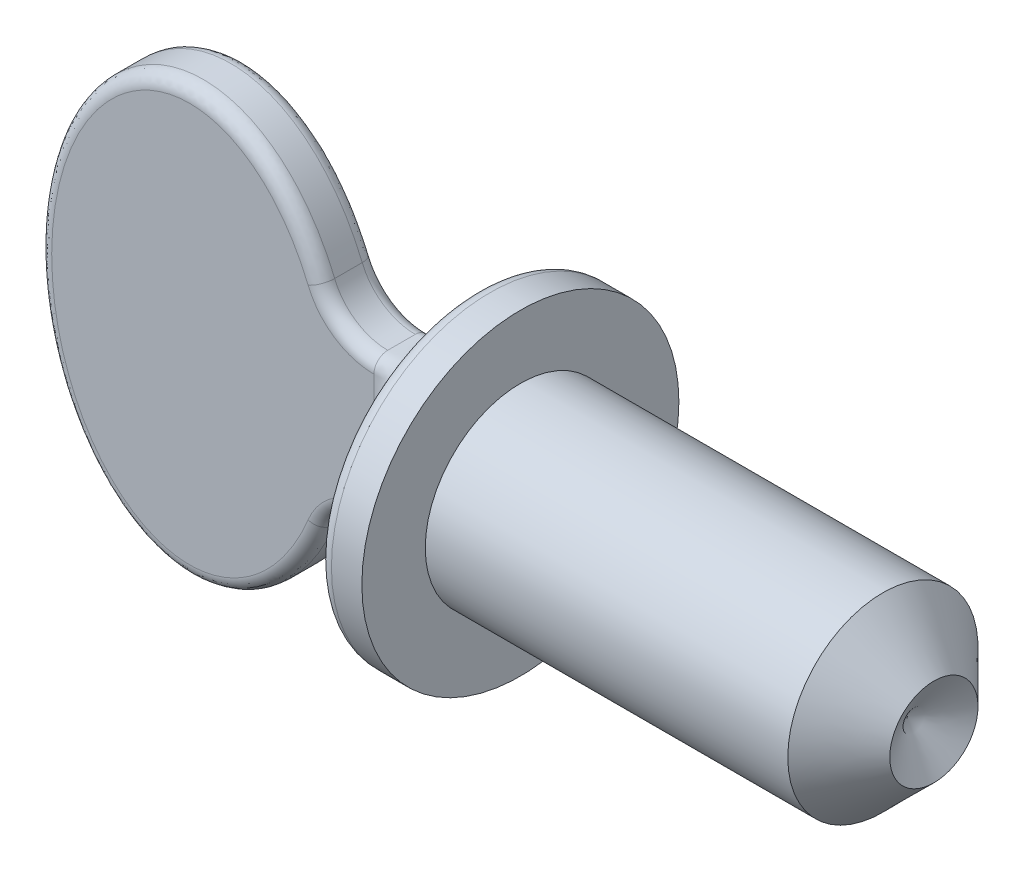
ISO-10303-21;
HEADER;
FILE_DESCRIPTION(('STEP AP214'),'2;1');
FILE_NAME('part.step','',(''),(''),'','','');
FILE_SCHEMA(('AUTOMOTIVE_DESIGN { 1 0 10303 214 1 1 1 1 }'));
ENDSEC;
DATA;
#1=APPLICATION_CONTEXT('core data for automotive mechanical design processes');
#2=APPLICATION_PROTOCOL_DEFINITION('international standard','automotive_design',2000,#1);
#3=PRODUCT_CONTEXT('',#1,'mechanical');
#4=PRODUCT('Part','Part','',(#3));
#5=PRODUCT_RELATED_PRODUCT_CATEGORY('part','',(#4));
#6=PRODUCT_DEFINITION_FORMATION('','',#4);
#7=PRODUCT_DEFINITION_CONTEXT('part definition',#1,'design');
#8=PRODUCT_DEFINITION('design','',#6,#7);
#9=PRODUCT_DEFINITION_SHAPE('','',#8);
#10=(LENGTH_UNIT() NAMED_UNIT(*) SI_UNIT(.MILLI.,.METRE.));
#11=(NAMED_UNIT(*) PLANE_ANGLE_UNIT() SI_UNIT($,.RADIAN.));
#12=(NAMED_UNIT(*) SI_UNIT($,.STERADIAN.) SOLID_ANGLE_UNIT());
#13=UNCERTAINTY_MEASURE_WITH_UNIT(LENGTH_MEASURE(1.E-05),#10,'distance_accuracy_value','');
#14=(GEOMETRIC_REPRESENTATION_CONTEXT(3) GLOBAL_UNCERTAINTY_ASSIGNED_CONTEXT((#13)) GLOBAL_UNIT_ASSIGNED_CONTEXT((#10,
#11,#12)) REPRESENTATION_CONTEXT('',''));
#15=CARTESIAN_POINT('',(0.,0.,0.));
#16=DIRECTION('',(0.,0.,1.));
#17=DIRECTION('',(1.,0.,0.));
#18=AXIS2_PLACEMENT_3D('',#15,#16,#17);
#19=CARTESIAN_POINT('',(3.39763741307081,-2.36920294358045,0.508));
#20=DIRECTION('',(0.,0.,-1.));
#21=DIRECTION('',(-1.,0.,0.));
#22=AXIS2_PLACEMENT_3D('',#19,#20,#21);
#23=CYLINDRICAL_SURFACE('',#22,1.05686961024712);
#24=DIRECTION('',(0.,0.,-1.));
#25=VECTOR('',#24,1.);
#26=CARTESIAN_POINT('',(2.41967497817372,-1.9685,0.508));
#27=LINE('',#26,#25);
#28=CARTESIAN_POINT('',(2.41967497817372,-1.9685,0.254));
#29=VERTEX_POINT('',#28);
#30=CARTESIAN_POINT('',(2.41967497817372,-1.9685,-0.254));
#31=VERTEX_POINT('',#30);
#32=EDGE_CURVE('E591',#29,#31,#27,.T.);
#33=ORIENTED_EDGE('',*,*,#32,.T.);
#34=CARTESIAN_POINT('',(3.39763741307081,-2.36920294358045,-0.254));
#35=DIRECTION('',(0.,0.,1.));
#36=DIRECTION('',(1.,0.,0.));
#37=AXIS2_PLACEMENT_3D('',#34,#35,#36);
#38=CIRCLE('',#37,1.05686961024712);
#39=CARTESIAN_POINT('',(3.39763741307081,-1.31233333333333,-0.254));
#40=VERTEX_POINT('',#39);
#41=EDGE_CURVE('E429',#31,#40,#38,.F.);
#42=ORIENTED_EDGE('',*,*,#41,.T.);
#43=DIRECTION('',(0.,0.,-1.));
#44=VECTOR('',#43,1.);
#45=CARTESIAN_POINT('',(3.39763741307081,-1.31233333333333,0.508));
#46=LINE('',#45,#44);
#47=CARTESIAN_POINT('',(3.39763741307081,-1.31233333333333,0.254));
#48=VERTEX_POINT('',#47);
#49=EDGE_CURVE('E548',#48,#40,#46,.T.);
#50=ORIENTED_EDGE('',*,*,#49,.F.);
#51=CARTESIAN_POINT('',(3.39763741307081,-2.36920294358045,0.254));
#52=DIRECTION('',(0.,0.,1.));
#53=DIRECTION('',(1.,0.,0.));
#54=AXIS2_PLACEMENT_3D('',#51,#52,#53);
#55=CIRCLE('',#54,1.05686961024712);
#56=EDGE_CURVE('E427',#48,#29,#55,.T.);
#57=ORIENTED_EDGE('',*,*,#56,.T.);
#58=EDGE_LOOP('',(#33,#42,#50,#57));
#59=FACE_BOUND('',#58,.T.);
#60=ADVANCED_FACE('F265',(#59),#23,.F.);
#61=CARTESIAN_POINT('',(3.39763741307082,2.36920294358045,0.508));
#62=DIRECTION('',(0.,0.,-1.));
#63=DIRECTION('',(-1.,0.,0.));
#64=AXIS2_PLACEMENT_3D('',#61,#62,#63);
#65=CYLINDRICAL_SURFACE('',#64,1.05686961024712);
#66=DIRECTION('',(0.,0.,-1.));
#67=VECTOR('',#66,1.);
#68=CARTESIAN_POINT('',(3.39763741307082,1.31233333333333,0.508));
#69=LINE('',#68,#67);
#70=CARTESIAN_POINT('',(3.39763741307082,1.31233333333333,0.254));
#71=VERTEX_POINT('',#70);
#72=CARTESIAN_POINT('',(3.39763741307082,1.31233333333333,-0.254));
#73=VERTEX_POINT('',#72);
#74=EDGE_CURVE('E595',#71,#73,#69,.T.);
#75=ORIENTED_EDGE('',*,*,#74,.T.);
#76=CARTESIAN_POINT('',(3.39763741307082,2.36920294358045,-0.254));
#77=DIRECTION('',(0.,0.,1.));
#78=DIRECTION('',(1.,0.,0.));
#79=AXIS2_PLACEMENT_3D('',#76,#77,#78);
#80=CIRCLE('',#79,1.05686961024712);
#81=CARTESIAN_POINT('',(2.41967497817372,1.9685,-0.254));
#82=VERTEX_POINT('',#81);
#83=EDGE_CURVE('E528',#73,#82,#80,.F.);
#84=ORIENTED_EDGE('',*,*,#83,.T.);
#85=DIRECTION('',(0.,0.,-1.));
#86=VECTOR('',#85,1.);
#87=CARTESIAN_POINT('',(2.41967497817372,1.9685,0.508));
#88=LINE('',#87,#86);
#89=CARTESIAN_POINT('',(2.41967497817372,1.9685,0.254));
#90=VERTEX_POINT('',#89);
#91=EDGE_CURVE('E593',#90,#82,#88,.T.);
#92=ORIENTED_EDGE('',*,*,#91,.F.);
#93=CARTESIAN_POINT('',(3.39763741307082,2.36920294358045,0.254));
#94=DIRECTION('',(0.,0.,1.));
#95=DIRECTION('',(1.,0.,0.));
#96=AXIS2_PLACEMENT_3D('',#93,#94,#95);
#97=CIRCLE('',#96,1.05686961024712);
#98=EDGE_CURVE('E532',#90,#71,#97,.T.);
#99=ORIENTED_EDGE('',*,*,#98,.T.);
#100=EDGE_LOOP('',(#75,#84,#92,#99));
#101=FACE_BOUND('',#100,.T.);
#102=ADVANCED_FACE('F352',(#101),#65,.F.);
#103=CARTESIAN_POINT('',(0.,0.,0.508));
#104=DIRECTION('',(0.,0.,1.));
#105=DIRECTION('',(0.,1.,0.));
#106=AXIS2_PLACEMENT_3D('',#103,#104,#105);
#107=ELLIPSE('',#106,3.937,2.794);
#108=DIRECTION('',(0.,0.,-1.));
#109=VECTOR('',#108,1.);
#110=SURFACE_OF_LINEAR_EXTRUSION('',#107,#109);
#111=ORIENTED_EDGE('',*,*,#91,.T.);
#112=CARTESIAN_POINT('',(-2.42953871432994,-1.06988650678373,-0.508));
#113=CARTESIAN_POINT('',(-2.67806308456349,-1.1223425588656,-0.508));
#114=CARTESIAN_POINT('',(-2.67806308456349,-1.1223425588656,-0.254));
#115=CARTESIAN_POINT('',(-2.38132756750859,-1.29830917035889,-0.508));
#116=CARTESIAN_POINT('',(-2.62738331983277,-1.36245895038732,-0.508));
#117=CARTESIAN_POINT('',(-2.62738331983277,-1.36245895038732,-0.254));
#118=CARTESIAN_POINT('',(-2.31706517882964,-1.52335296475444,-0.508));
#119=CARTESIAN_POINT('',(-2.55974244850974,-1.59951584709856,-0.508));
#120=CARTESIAN_POINT('',(-2.55974244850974,-1.59951584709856,-0.254));
#121=CARTESIAN_POINT('',(-2.15402597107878,-1.9606753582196,-0.508));
#122=CARTESIAN_POINT('',(-2.38735395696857,-2.06194694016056,-0.508));
#123=CARTESIAN_POINT('',(-2.38735395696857,-2.06194694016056,-0.254));
#124=CARTESIAN_POINT('',(-2.05530031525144,-2.17297233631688,-0.508));
#125=CARTESIAN_POINT('',(-2.28266133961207,-2.28733788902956,-0.508));
#126=CARTESIAN_POINT('',(-2.28266133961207,-2.28733788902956,-0.254));
#127=CARTESIAN_POINT('',(-1.8565056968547,-2.51319514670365,-0.508));
#128=CARTESIAN_POINT('',(-2.0702557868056,-2.65084271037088,-0.508));
#129=CARTESIAN_POINT('',(-2.0702557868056,-2.65084271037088,-0.254));
#130=CARTESIAN_POINT('',(-1.76631603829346,-2.64689289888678,-0.508));
#131=CARTESIAN_POINT('',(-1.97351333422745,-2.79437306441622,-0.508));
#132=CARTESIAN_POINT('',(-1.97351333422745,-2.79437306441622,-0.254));
#133=CARTESIAN_POINT('',(-1.56670354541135,-2.89917346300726,-0.508));
#134=CARTESIAN_POINT('',(-1.75790917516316,-3.06687436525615,-0.508));
#135=CARTESIAN_POINT('',(-1.75790917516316,-3.06687436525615,-0.254));
#136=CARTESIAN_POINT('',(-1.45730856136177,-3.01777773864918,-0.508));
#137=CARTESIAN_POINT('',(-1.63907948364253,-3.19586595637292,-0.508));
#138=CARTESIAN_POINT('',(-1.63907948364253,-3.19586595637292,-0.254));
#139=CARTESIAN_POINT('',(-1.24726681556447,-3.20759724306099,-0.508));
#140=CARTESIAN_POINT('',(-1.40883959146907,-3.40393298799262,-0.508));
#141=CARTESIAN_POINT('',(-1.40883959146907,-3.40393298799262,-0.254));
#142=CARTESIAN_POINT('',(-1.1507555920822,-3.28336841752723,-0.508));
#143=CARTESIAN_POINT('',(-1.30241841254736,-3.487576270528,-0.508));
#144=CARTESIAN_POINT('',(-1.30241841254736,-3.487576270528,-0.254));
#145=CARTESIAN_POINT('',(-0.946803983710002,-3.41849479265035,-0.508));
#146=CARTESIAN_POINT('',(-1.07576597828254,-3.63774144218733,-0.508));
#147=CARTESIAN_POINT('',(-1.07576597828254,-3.63774144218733,-0.254));
#148=CARTESIAN_POINT('',(-0.839378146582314,-3.47787146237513,-0.508));
#149=CARTESIAN_POINT('',(-0.955553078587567,-3.70428571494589,-0.508));
#150=CARTESIAN_POINT('',(-0.955553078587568,-3.70428571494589,-0.254));
#151=CARTESIAN_POINT('',(-0.633843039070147,-3.56789218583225,-0.508));
#152=CARTESIAN_POINT('',(-0.723818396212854,-3.80577636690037,-0.508));
#153=CARTESIAN_POINT('',(-0.723818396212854,-3.80577636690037,-0.254));
#154=CARTESIAN_POINT('',(-0.537108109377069,-3.60165598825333,-0.508));
#155=CARTESIAN_POINT('',(-0.614119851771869,-3.84411987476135,-0.508));
#156=CARTESIAN_POINT('',(-0.614119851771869,-3.84411987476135,-0.254));
#157=CARTESIAN_POINT('',(-0.339331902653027,-3.65248383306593,-0.508));
#158=CARTESIAN_POINT('',(-0.388801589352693,-3.90202243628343,-0.508));
#159=CARTESIAN_POINT('',(-0.388801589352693,-3.90202243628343,-0.254));
#160=CARTESIAN_POINT('',(-0.238293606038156,-3.66955924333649,-0.508));
#161=CARTESIAN_POINT('',(-0.273185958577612,-3.92159427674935,-0.508));
#162=CARTESIAN_POINT('',(-0.273185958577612,-3.92159427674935,-0.254));
#163=CARTESIAN_POINT('',(-0.0344753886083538,-3.68567445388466,-0.508));
#164=CARTESIAN_POINT('',(-0.0395873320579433,-3.94006182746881,-0.508));
#165=CARTESIAN_POINT('',(-0.0395873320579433,-3.94006182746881,-0.254));
#166=CARTESIAN_POINT('',(0.0683086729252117,-3.68466274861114,-0.508));
#167=CARTESIAN_POINT('',(0.0784014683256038,-3.93889849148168,-0.508));
#168=CARTESIAN_POINT('',(0.0784014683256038,-3.93889849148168,-0.254));
#169=CARTESIAN_POINT('',(0.272088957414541,-3.66456417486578,-0.508));
#170=CARTESIAN_POINT('',(0.311869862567,-3.91587428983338,-0.508));
#171=CARTESIAN_POINT('',(0.311869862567,-3.91587428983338,-0.254));
#172=CARTESIAN_POINT('',(0.373084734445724,-3.64547286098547,-0.508));
#173=CARTESIAN_POINT('',(0.427348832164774,-3.89400833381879,-0.508));
#174=CARTESIAN_POINT('',(0.427348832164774,-3.89400833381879,-0.254));
#175=CARTESIAN_POINT('',(0.566584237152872,-3.5918099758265,-0.508));
#176=CARTESIAN_POINT('',(0.647572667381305,-3.83293861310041,-0.508));
#177=CARTESIAN_POINT('',(0.647572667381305,-3.83293861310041,-0.254));
#178=CARTESIAN_POINT('',(0.659265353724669,-3.5578663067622,-0.508));
#179=CARTESIAN_POINT('',(0.75256001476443,-3.79443882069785,-0.508));
#180=CARTESIAN_POINT('',(0.75256001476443,-3.79443882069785,-0.254));
#181=CARTESIAN_POINT('',(0.838615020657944,-3.47679355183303,-0.508));
#182=CARTESIAN_POINT('',(0.954592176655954,-3.70311336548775,-0.508));
#183=CARTESIAN_POINT('',(0.954592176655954,-3.70311336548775,-0.254));
#184=CARTESIAN_POINT('',(0.925281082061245,-3.42965904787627,-0.508));
#185=CARTESIAN_POINT('',(1.05163370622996,-3.65028181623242,-0.508));
#186=CARTESIAN_POINT('',(1.05163370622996,-3.65028181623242,-0.254));
#187=CARTESIAN_POINT('',(1.12953179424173,-3.30045366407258,-0.508));
#188=CARTESIAN_POINT('',(1.27904250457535,-3.50643406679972,-0.508));
#189=CARTESIAN_POINT('',(1.27904250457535,-3.50643406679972,-0.254));
#190=CARTESIAN_POINT('',(1.24323792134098,-3.21224549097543,-0.508));
#191=CARTESIAN_POINT('',(1.40447787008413,-3.40898221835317,-0.508));
#192=CARTESIAN_POINT('',(1.40447787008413,-3.40898221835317,-0.254));
#193=CARTESIAN_POINT('',(1.45504675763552,-3.01870052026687,-0.508));
#194=CARTESIAN_POINT('',(1.63653892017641,-3.19692872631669,-0.508));
#195=CARTESIAN_POINT('',(1.63653892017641,-3.19692872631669,-0.254));
#196=CARTESIAN_POINT('',(1.55311138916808,-2.91332314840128,-0.508));
#197=CARTESIAN_POINT('',(1.74311876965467,-3.08228651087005,-0.508));
#198=CARTESIAN_POINT('',(1.74311876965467,-3.08228651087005,-0.254));
#199=CARTESIAN_POINT('',(1.75678198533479,-2.66196868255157,-0.508));
#200=CARTESIAN_POINT('',(1.9633248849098,-2.81052824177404,-0.508));
#201=CARTESIAN_POINT('',(1.9633248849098,-2.81052824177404,-0.254));
#202=CARTESIAN_POINT('',(1.85800944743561,-2.51246781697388,-0.508));
#203=CARTESIAN_POINT('',(2.07190130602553,-2.65000792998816,-0.508));
#204=CARTESIAN_POINT('',(2.07190130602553,-2.65000792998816,-0.254));
#205=CARTESIAN_POINT('',(2.03785333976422,-2.20076254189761,-0.508));
#206=CARTESIAN_POINT('',(2.26397611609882,-2.31709468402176,-0.508));
#207=CARTESIAN_POINT('',(2.26397611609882,-2.31709468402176,-0.254));
#208=CARTESIAN_POINT('',(2.11647846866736,-2.03856305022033,-0.508));
#209=CARTESIAN_POINT('',(2.34748415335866,-2.14470634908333,-0.508));
#210=CARTESIAN_POINT('',(2.34748415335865,-2.14470634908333,-0.254));
#211=CARTESIAN_POINT('',(2.22461915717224,-1.7746150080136,-0.508));
#212=CARTESIAN_POINT('',(2.46201925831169,-1.8651443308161,-0.508));
#213=CARTESIAN_POINT('',(2.46201925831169,-1.8651443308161,-0.254));
#214=CARTESIAN_POINT('',(2.2609989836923,-1.67559877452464,-0.508));
#215=CARTESIAN_POINT('',(2.5004698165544,-1.76047506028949,-0.508));
#216=CARTESIAN_POINT('',(2.5004698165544,-1.76047506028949,-0.254));
#217=CARTESIAN_POINT('',(2.32683156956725,-1.47533598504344,-0.508));
#218=CARTESIAN_POINT('',(2.56995291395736,-1.54910644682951,-0.508));
#219=CARTESIAN_POINT('',(2.56995291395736,-1.54910644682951,-0.254));
#220=CARTESIAN_POINT('',(2.35628633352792,-1.37409008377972,-0.508));
#221=CARTESIAN_POINT('',(2.60098759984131,-1.44240770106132,-0.508));
#222=CARTESIAN_POINT('',(2.60098759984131,-1.44240770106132,-0.254));
#223=CARTESIAN_POINT('',(2.45282237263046,-0.99672785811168,-0.508));
#224=CARTESIAN_POINT('',(2.70261039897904,-1.04518135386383,-0.508));
#225=CARTESIAN_POINT('',(2.70261039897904,-1.04518135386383,-0.254));
#226=CARTESIAN_POINT('',(2.49907252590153,-0.715044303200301,-0.508));
#227=CARTESIAN_POINT('',(2.7510952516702,-0.74956565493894,-0.508));
#228=CARTESIAN_POINT('',(2.7510952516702,-0.74956565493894,-0.254));
#229=CARTESIAN_POINT('',(2.54567248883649,-0.147495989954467,-0.508));
#230=CARTESIAN_POINT('',(2.79994937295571,-0.154504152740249,-0.508));
#231=CARTESIAN_POINT('',(2.79994937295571,-0.154504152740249,-0.254));
#232=CARTESIAN_POINT('',(2.54590842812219,0.138377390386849,-0.508));
#233=CARTESIAN_POINT('',(2.80019927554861,0.144949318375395,-0.508));
#234=CARTESIAN_POINT('',(2.80019927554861,0.144949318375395,-0.254));
#235=CARTESIAN_POINT('',(2.50314262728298,0.670744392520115,-0.508));
#236=CARTESIAN_POINT('',(2.75536014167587,0.703113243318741,-0.508));
#237=CARTESIAN_POINT('',(2.75536014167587,0.703113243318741,-0.254));
#238=CARTESIAN_POINT('',(2.46556625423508,0.917675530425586,-0.508));
#239=CARTESIAN_POINT('',(2.71596009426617,0.962218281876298,-0.508));
#240=CARTESIAN_POINT('',(2.71596009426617,0.962218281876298,-0.254));
#241=CARTESIAN_POINT('',(2.35351407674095,1.40317160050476,-0.508));
#242=CARTESIAN_POINT('',(2.5981091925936,1.47286514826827,-0.508));
#243=CARTESIAN_POINT('',(2.5981091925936,1.47286514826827,-0.254));
#244=CARTESIAN_POINT('',(2.27905720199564,1.64174075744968,-0.508));
#245=CARTESIAN_POINT('',(2.51967837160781,1.72441078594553,-0.508));
#246=CARTESIAN_POINT('',(2.51967837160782,1.72441078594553,-0.254));
#247=CARTESIAN_POINT('',(2.10296943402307,2.07153806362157,-0.508));
#248=CARTESIAN_POINT('',(2.33317448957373,2.17963119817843,-0.508));
#249=CARTESIAN_POINT('',(2.33317448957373,2.17963119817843,-0.254));
#250=CARTESIAN_POINT('',(2.00636516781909,2.26480890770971,-0.508));
#251=CARTESIAN_POINT('',(2.23053377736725,2.38518362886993,-0.508));
#252=CARTESIAN_POINT('',(2.23053377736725,2.38518362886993,-0.254));
#253=CARTESIAN_POINT('',(1.78047465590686,2.63124667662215,-0.508));
#254=CARTESIAN_POINT('',(1.98878457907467,2.77737954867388,-0.508));
#255=CARTESIAN_POINT('',(1.98878457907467,2.77737954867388,-0.254));
#256=CARTESIAN_POINT('',(1.65129083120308,2.80447416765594,-0.508));
#257=CARTESIAN_POINT('',(1.84979032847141,2.96407977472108,-0.508));
#258=CARTESIAN_POINT('',(1.84979032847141,2.96407977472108,-0.254));
#259=CARTESIAN_POINT('',(1.41779860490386,3.05444647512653,-0.508));
#260=CARTESIAN_POINT('',(1.59578914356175,3.23598875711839,-0.508));
#261=CARTESIAN_POINT('',(1.59578914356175,3.23598875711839,-0.254));
#262=CARTESIAN_POINT('',(1.32477852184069,3.14175732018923,-0.508));
#263=CARTESIAN_POINT('',(1.49405856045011,3.33156937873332,-0.508));
#264=CARTESIAN_POINT('',(1.49405856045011,3.33156937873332,-0.254));
#265=CARTESIAN_POINT('',(1.1264653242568,3.3011914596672,-0.508));
#266=CARTESIAN_POINT('',(1.27551873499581,3.50726804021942,-0.508));
#267=CARTESIAN_POINT('',(1.27551873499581,3.50726804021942,-0.254));
#268=CARTESIAN_POINT('',(1.02118853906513,3.37333460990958,-0.508));
#269=CARTESIAN_POINT('',(1.15872953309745,3.58740628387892,-0.508));
#270=CARTESIAN_POINT('',(1.15872953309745,3.58740628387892,-0.254));
#271=CARTESIAN_POINT('',(0.817330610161,3.48785914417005,-0.508));
#272=CARTESIAN_POINT('',(0.930720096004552,3.7154934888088,-0.508));
#273=CARTESIAN_POINT('',(0.930720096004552,3.7154934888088,-0.254));
#274=CARTESIAN_POINT('',(0.720402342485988,3.53316262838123,-0.508));
#275=CARTESIAN_POINT('',(0.821632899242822,3.76654812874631,-0.508));
#276=CARTESIAN_POINT('',(0.821632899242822,3.76654812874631,-0.254));
#277=CARTESIAN_POINT('',(0.520328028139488,3.60703504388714,-0.508));
#278=CARTESIAN_POINT('',(0.595089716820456,3.85018992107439,-0.508));
#279=CARTESIAN_POINT('',(0.595089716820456,3.85018992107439,-0.254));
#280=CARTESIAN_POINT('',(0.417186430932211,3.63561579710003,-0.508));
#281=CARTESIAN_POINT('',(0.477639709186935,3.88279011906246,-0.508));
#282=CARTESIAN_POINT('',(0.477639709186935,3.88279011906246,-0.254));
#283=CARTESIAN_POINT('',(0.206818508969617,3.67387815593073,-0.508));
#284=CARTESIAN_POINT('',(0.237206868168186,3.92651558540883,-0.508));
#285=CARTESIAN_POINT('',(0.237206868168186,3.92651558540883,-0.254));
#286=CARTESIAN_POINT('',(0.0995732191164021,3.68345742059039,-0.508));
#287=CARTESIAN_POINT('',(0.114197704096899,3.9375245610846,-0.508));
#288=CARTESIAN_POINT('',(0.114197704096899,3.9375245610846,-0.254));
#289=CARTESIAN_POINT('',(-0.114821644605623,3.68250895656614,-0.508));
#290=CARTESIAN_POINT('',(-0.131686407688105,3.93643687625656,-0.508));
#291=CARTESIAN_POINT('',(-0.131686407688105,3.93643687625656,-0.254));
#292=CARTESIAN_POINT('',(-0.221971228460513,3.67198365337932,-0.508));
#293=CARTESIAN_POINT('',(-0.254561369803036,3.92434300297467,-0.508));
#294=CARTESIAN_POINT('',(-0.254561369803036,3.92434300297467,-0.254));
#295=CARTESIAN_POINT('',(-0.423404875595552,3.6335702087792,-0.508));
#296=CARTESIAN_POINT('',(-0.484708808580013,3.88045959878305,-0.508));
#297=CARTESIAN_POINT('',(-0.484708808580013,3.88045959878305,-0.254));
#298=CARTESIAN_POINT('',(-0.517999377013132,3.60726509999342,-0.508));
#299=CARTESIAN_POINT('',(-0.592410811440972,3.85046695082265,-0.508));
#300=CARTESIAN_POINT('',(-0.592410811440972,3.85046695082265,-0.254));
#301=CARTESIAN_POINT('',(-0.702018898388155,3.54051420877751,-0.508));
#302=CARTESIAN_POINT('',(-0.80085538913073,3.77485728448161,-0.508));
#303=CARTESIAN_POINT('',(-0.800855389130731,3.77485728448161,-0.254));
#304=CARTESIAN_POINT('',(-0.791441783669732,3.5000626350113,-0.508));
#305=CARTESIAN_POINT('',(-0.901595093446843,3.72923386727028,-0.508));
#306=CARTESIAN_POINT('',(-0.901595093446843,3.72923386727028,-0.254));
#307=CARTESIAN_POINT('',(-0.995772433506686,3.38993421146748,-0.508));
#308=CARTESIAN_POINT('',(-1.13047031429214,3.60588286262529,-0.508));
#309=CARTESIAN_POINT('',(-1.13047031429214,3.60588286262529,-0.254));
#310=CARTESIAN_POINT('',(-1.10783636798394,3.31498239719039,-0.508));
#311=CARTESIAN_POINT('',(-1.25491481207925,3.52252387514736,-0.508));
#312=CARTESIAN_POINT('',(-1.25491481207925,3.52252387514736,-0.254));
#313=CARTESIAN_POINT('',(-1.31837395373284,3.14796333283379,-0.508));
#314=CARTESIAN_POINT('',(-1.48706802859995,3.33835616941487,-0.508));
#315=CARTESIAN_POINT('',(-1.48706802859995,3.33835616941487,-0.254));
#316=CARTESIAN_POINT('',(-1.41681992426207,3.05586208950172,-0.508));
#317=CARTESIAN_POINT('',(-1.59474271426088,3.23751282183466,-0.508));
#318=CARTESIAN_POINT('',(-1.59474271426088,3.23751282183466,-0.254));
#319=CARTESIAN_POINT('',(-1.63609804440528,2.82020806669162,-0.508));
#320=CARTESIAN_POINT('',(-1.83323646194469,2.98121697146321,-0.508));
#321=CARTESIAN_POINT('',(-1.83323646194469,2.98121697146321,-0.254));
#322=CARTESIAN_POINT('',(-1.75048386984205,2.67067473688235,-0.508));
#323=CARTESIAN_POINT('',(-1.95647717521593,2.81989583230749,-0.508));
#324=CARTESIAN_POINT('',(-1.95647717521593,2.81989583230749,-0.254));
#325=CARTESIAN_POINT('',(-1.95420988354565,2.35553788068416,-0.508));
#326=CARTESIAN_POINT('',(-2.1748556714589,2.48207587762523,-0.508));
#327=CARTESIAN_POINT('',(-2.1748556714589,2.48207587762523,-0.254));
#328=CARTESIAN_POINT('',(-2.04350621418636,2.18990688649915,-0.508));
#329=CARTESIAN_POINT('',(-2.2699442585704,2.30555118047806,-0.508));
#330=CARTESIAN_POINT('',(-2.2699442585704,2.30555118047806,-0.254));
#331=CARTESIAN_POINT('',(-2.22882804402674,1.78241164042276,-0.508));
#332=CARTESIAN_POINT('',(-2.46665332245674,1.87302961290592,-0.508));
#333=CARTESIAN_POINT('',(-2.46665332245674,1.87302961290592,-0.254));
#334=CARTESIAN_POINT('',(-2.3142397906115,1.53572223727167,-0.508));
#335=CARTESIAN_POINT('',(-2.55672789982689,1.61257271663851,-0.508));
#336=CARTESIAN_POINT('',(-2.55672789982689,1.61257271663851,-0.254));
#337=CARTESIAN_POINT('',(-2.44446639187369,1.03199799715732,-0.508));
#338=CARTESIAN_POINT('',(-2.69381177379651,1.08228449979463,-0.508));
#339=CARTESIAN_POINT('',(-2.69381177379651,1.08228449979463,-0.254));
#340=CARTESIAN_POINT('',(-2.48924065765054,0.774953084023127,-0.508));
#341=CARTESIAN_POINT('',(-2.74077801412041,0.812444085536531,-0.508));
#342=CARTESIAN_POINT('',(-2.74077801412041,0.812444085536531,-0.254));
#343=CARTESIAN_POINT('',(-2.54075598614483,0.251563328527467,-0.508));
#344=CARTESIAN_POINT('',(-2.79480168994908,0.263568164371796,-0.508));
#345=CARTESIAN_POINT('',(-2.79480168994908,0.263568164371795,-0.254));
#346=CARTESIAN_POINT('',(-2.54666205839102,-0.0148627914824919,-0.508));
#347=CARTESIAN_POINT('',(-2.80098296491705,-0.015540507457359,-0.508));
#348=CARTESIAN_POINT('',(-2.80098296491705,-0.0155405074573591,-0.254));
#349=CARTESIAN_POINT('',(-2.51848120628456,-0.545613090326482,-0.508));
#350=CARTESIAN_POINT('',(-2.77144588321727,-0.571867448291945,-0.508));
#351=CARTESIAN_POINT('',(-2.77144588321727,-0.571867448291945,-0.254));
#352=CARTESIAN_POINT('',(-2.48440379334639,-0.809937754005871,-0.508));
#353=CARTESIAN_POINT('',(-2.73573749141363,-0.849086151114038,-0.508));
#354=CARTESIAN_POINT('',(-2.73573749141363,-0.849086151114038,-0.254));
#355=CARTESIAN_POINT('',(-2.42953871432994,-1.06988650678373,-0.508));
#356=CARTESIAN_POINT('',(-2.67806308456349,-1.1223425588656,-0.508));
#357=CARTESIAN_POINT('',(-2.67806308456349,-1.1223425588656,-0.254));
#358=(BOUNDED_SURFACE() B_SPLINE_SURFACE(3,2,((#112,#113,#114),(#115,#116,#117),(#118,#119,
#120),(#121,#122,#123),(#124,#125,#126),(#127,#128,#129),(#130,#131,#132),(#133,#134,#135),
(#136,#137,#138),(#139,#140,#141),(#142,#143,#144),(#145,#146,#147),(#148,#149,#150),(#151,#152,
#153),(#154,#155,#156),(#157,#158,#159),(#160,#161,#162),(#163,#164,#165),(#166,#167,#168),
(#169,#170,#171),(#172,#173,#174),(#175,#176,#177),(#178,#179,#180),(#181,#182,#183),(#184,#185,
#186),(#187,#188,#189),(#190,#191,#192),(#193,#194,#195),(#196,#197,#198),(#199,#200,#201),
(#202,#203,#204),(#205,#206,#207),(#208,#209,#210),(#211,#212,#213),(#214,#215,#216),(#217,#218,
#219),(#220,#221,#222),(#223,#224,#225),(#226,#227,#228),(#229,#230,#231),(#232,#233,#234),
(#235,#236,#237),(#238,#239,#240),(#241,#242,#243),(#244,#245,#246),(#247,#248,#249),(#250,#251,
#252),(#253,#254,#255),(#256,#257,#258),(#259,#260,#261),(#262,#263,#264),(#265,#266,#267),
(#268,#269,#270),(#271,#272,#273),(#274,#275,#276),(#277,#278,#279),(#280,#281,#282),(#283,#284,
#285),(#286,#287,#288),(#289,#290,#291),(#292,#293,#294),(#295,#296,#297),(#298,#299,#300),
(#301,#302,#303),(#304,#305,#306),(#307,#308,#309),(#310,#311,#312),(#313,#314,#315),(#316,#317,
#318),(#319,#320,#321),(#322,#323,#324),(#325,#326,#327),(#328,#329,#330),(#331,#332,#333),
(#334,#335,#336),(#337,#338,#339),(#340,#341,#342),(#343,#344,#345),(#346,#347,#348),(#349,#350,
#351),(#352,#353,#354),(#355,#356,#357)),.UNSPECIFIED.,.T.,.F.,
.F.) B_SPLINE_SURFACE_WITH_KNOTS((4,2,2,2,2,2,2,2,2,2,2,2,2,2,2,2,2,2,2,2,2,2,2,2,2,2,2,2,2,2,2,
2,2,2,2,2,2,2,2,2,4),(3,3),(0.,0.699735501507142,1.39843658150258,1.88081590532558,
2.36250140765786,2.7293120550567,3.09564005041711,3.401707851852,3.7075670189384,
4.01429730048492,4.32110302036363,4.61603131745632,4.91108093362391,5.34040544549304,
5.77075965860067,6.31008999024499,6.84921247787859,7.16544039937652,7.48157666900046,
8.33348152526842,9.18749454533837,9.93427445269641,10.6806714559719,11.3262865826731,
11.9698968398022,12.3514499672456,12.7325004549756,13.052173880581,13.371621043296,
13.6927841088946,14.0139084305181,14.3072154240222,14.6006426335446,15.0028628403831,
15.405888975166,15.9675913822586,16.530269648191,17.3092934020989,18.0890943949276,
18.8855943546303,19.6819048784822),(0.,1.),
.UNSPECIFIED.) GEOMETRIC_REPRESENTATION_ITEM() RATIONAL_B_SPLINE_SURFACE(((1.,0.707106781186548,
1.),(1.,0.707106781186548,1.),(1.,0.707106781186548,1.),(1.,0.707106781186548,1.),(1.,
0.707106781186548,1.),(1.,0.707106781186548,1.),(1.,0.707106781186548,1.),(1.,0.707106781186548,
1.),(1.,0.707106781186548,1.),(1.,0.707106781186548,1.),(1.,0.707106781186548,1.),(1.,
0.707106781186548,1.),(1.,0.707106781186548,1.),(1.,0.707106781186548,1.),(1.,0.707106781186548,
1.),(1.,0.707106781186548,1.),(1.,0.707106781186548,1.),(1.,0.707106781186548,1.),(1.,
0.707106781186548,1.),(1.,0.707106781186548,1.),(1.,0.707106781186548,1.),(1.,0.707106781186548,
1.),(1.,0.707106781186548,1.),(1.,0.707106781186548,1.),(1.,0.707106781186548,1.),(1.,
0.707106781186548,1.),(1.,0.707106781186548,1.),(1.,0.707106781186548,1.),(1.,0.707106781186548,
1.),(1.,0.707106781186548,1.),(1.,0.707106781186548,1.),(1.,0.707106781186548,1.),(1.,
0.707106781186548,1.),(1.,0.707106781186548,1.),(1.,0.707106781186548,1.),(1.,0.707106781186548,
1.),(1.,0.707106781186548,1.),(1.,0.707106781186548,1.),(1.,0.707106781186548,1.),(1.,
0.707106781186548,1.),(1.,0.707106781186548,1.),(1.,0.707106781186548,1.),(1.,0.707106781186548,
1.),(1.,0.707106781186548,1.),(1.,0.707106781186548,1.),(1.,0.707106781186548,1.),(1.,
0.707106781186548,1.),(1.,0.707106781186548,1.),(1.,0.707106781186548,1.),(1.,0.707106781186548,
1.),(1.,0.707106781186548,1.),(1.,0.707106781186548,1.),(1.,0.707106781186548,1.),(1.,
0.707106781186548,1.),(1.,0.707106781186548,1.),(1.,0.707106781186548,1.),(1.,0.707106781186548,
1.),(1.,0.707106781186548,1.),(1.,0.707106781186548,1.),(1.,0.707106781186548,1.),(1.,
0.707106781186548,1.),(1.,0.707106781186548,1.),(1.,0.707106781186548,1.),(1.,0.707106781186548,
1.),(1.,0.707106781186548,1.),(1.,0.707106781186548,1.),(1.,0.707106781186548,1.),(1.,
0.707106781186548,1.),(1.,0.707106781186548,1.),(1.,0.707106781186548,1.),(1.,0.707106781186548,
1.),(1.,0.707106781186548,1.),(1.,0.707106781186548,1.),(1.,0.707106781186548,1.),(1.,
0.707106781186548,1.),(1.,0.707106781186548,1.),(1.,0.707106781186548,1.),(1.,0.707106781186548,
1.),(1.,0.707106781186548,1.),(1.,0.707106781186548,1.),(1.,0.707106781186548,1.),(1.,
0.707106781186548,1.))) REPRESENTATION_ITEM('') SURFACE());
#359=CARTESIAN_POINT('',(2.41967497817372,1.9685,-0.254));
#360=CARTESIAN_POINT('',(2.25031042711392,2.38542945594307,-0.254));
#361=CARTESIAN_POINT('',(2.00596675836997,2.79648158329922,-0.254));
#362=CARTESIAN_POINT('',(1.49799160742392,3.34093166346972,-0.254));
#363=CARTESIAN_POINT('',(1.27918524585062,3.52006526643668,-0.254));
#364=CARTESIAN_POINT('',(0.824519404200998,3.77487228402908,-0.254));
#365=CARTESIAN_POINT('',(0.5953372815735,3.86152000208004,-0.254));
#366=CARTESIAN_POINT('',(0.11627433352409,3.94837182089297,-0.254));
#367=CARTESIAN_POINT('',(-0.133883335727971,3.94714153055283,-0.254));
#368=CARTESIAN_POINT('',(-0.592713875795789,3.86005719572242,-0.254));
#369=CARTESIAN_POINT('',(-0.803064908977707,3.78232434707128,-0.254));
#370=CARTESIAN_POINT('',(-1.25884339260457,3.53671269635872,-0.254));
#371=CARTESIAN_POINT('',(-1.49225794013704,3.34730250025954,-0.254));
#372=CARTESIAN_POINT('',(-1.9688886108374,2.83590773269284,-0.254));
#373=CARTESIAN_POINT('',(-2.18567037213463,2.49073765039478,-0.254));
#374=CARTESIAN_POINT('',(-2.57946081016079,1.62514496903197,-0.254));
#375=CARTESIAN_POINT('',(-2.71380281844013,1.08646076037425,-0.254));
#376=CARTESIAN_POINT('',(-2.82215303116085,-0.0142692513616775,-0.254));
#377=CARTESIAN_POINT('',(-2.79328752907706,-0.576559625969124,-0.254));
#378=CARTESIAN_POINT('',(-2.5760189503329,-1.60569439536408,-0.254));
#379=CARTESIAN_POINT('',(-2.40624277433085,-2.07609930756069,-0.254));
#380=CARTESIAN_POINT('',(-1.98146625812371,-2.80261486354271,-0.254));
#381=CARTESIAN_POINT('',(-1.76650882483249,-3.08096180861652,-0.254));
#382=CARTESIAN_POINT('',(-1.30657381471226,-3.49615219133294,-0.254));
#383=CARTESIAN_POINT('',(-1.07838575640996,-3.65062001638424,-0.254));
#384=CARTESIAN_POINT('',(-0.616409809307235,-3.85270583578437,-0.254));
#385=CARTESIAN_POINT('',(-0.388253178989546,-3.91258803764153,-0.254));
#386=CARTESIAN_POINT('',(0.0769150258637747,-3.94918083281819,-0.254));
#387=CARTESIAN_POINT('',(0.313980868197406,-3.92525354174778,-0.254));
#388=CARTESIAN_POINT('',(0.753403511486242,-3.80377336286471,-0.254));
#389=CARTESIAN_POINT('',(0.956930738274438,-3.71016433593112,-0.254));
#390=CARTESIAN_POINT('',(1.40977740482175,-3.42376866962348,-0.254));
#391=CARTESIAN_POINT('',(1.6427552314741,-3.20589476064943,-0.254));
#392=CARTESIAN_POINT('',(2.03111441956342,-2.72710992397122,-0.254));
#393=CARTESIAN_POINT('',(2.18919790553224,-2.46823947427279,-0.254));
#394=CARTESIAN_POINT('',(2.35453247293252,-2.12142025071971,-0.254));
#395=CARTESIAN_POINT('',(2.38815642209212,-2.04532960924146,-0.254));
#396=CARTESIAN_POINT('',(2.41967497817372,-1.9685,-0.254));
#397=B_SPLINE_CURVE_WITH_KNOTS('',3,(#359,#360,#361,#362,#363,#364,#365,#366,#367,#368,#369,
#370,#371,#372,#373,#374,#375,#376,#377,#378,#379,#380,#381,#382,#383,#384,#385,#386,#387,#388,
#389,#390,#391,#392,#393,#394,#395,#396),.UNSPECIFIED.,.F.,.F.,(4,2,2,2,2,2,2,2,2,2,2,2,2,2,2,2,
2,2,4),(0.,1.37556453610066,2.21375379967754,2.93458248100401,3.66717955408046,4.32956836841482,
5.21483606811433,6.41718702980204,8.05393798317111,9.71959706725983,11.1947245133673,
12.2336794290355,13.0458946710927,13.740094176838,14.4395887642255,15.1022444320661,
16.0414723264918,16.9435917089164,17.1929672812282),.UNSPECIFIED.);
#398=EDGE_CURVE('E553',#82,#31,#397,.T.);
#399=ORIENTED_EDGE('',*,*,#398,.T.);
#400=ORIENTED_EDGE('',*,*,#32,.F.);
#401=CARTESIAN_POINT('',(-2.42953871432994,1.06988650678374,0.508));
#402=CARTESIAN_POINT('',(-2.67806308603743,1.12234255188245,0.508));
#403=CARTESIAN_POINT('',(-2.67806308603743,1.12234255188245,0.254));
#404=CARTESIAN_POINT('',(-2.38132756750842,1.29830917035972,0.508));
#405=CARTESIAN_POINT('',(-2.62738332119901,1.36245894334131,0.508));
#406=CARTESIAN_POINT('',(-2.62738332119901,1.36245894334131,0.254));
#407=CARTESIAN_POINT('',(-2.31706517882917,1.52335296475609,0.508));
#408=CARTESIAN_POINT('',(-2.55974244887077,1.59951584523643,0.508));
#409=CARTESIAN_POINT('',(-2.55974244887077,1.59951584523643,0.254));
#410=CARTESIAN_POINT('',(-2.15402597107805,1.96067535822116,0.508));
#411=CARTESIAN_POINT('',(-2.38735395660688,2.06194694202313,0.508));
#412=CARTESIAN_POINT('',(-2.38735395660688,2.06194694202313,0.254));
#413=CARTESIAN_POINT('',(-2.05530031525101,2.17297233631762,0.508));
#414=CARTESIAN_POINT('',(-2.28266133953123,2.28733788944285,0.508));
#415=CARTESIAN_POINT('',(-2.28266133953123,2.28733788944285,0.254));
#416=CARTESIAN_POINT('',(-1.8565056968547,2.51319514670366,0.508));
#417=CARTESIAN_POINT('',(-2.07025578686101,2.65084271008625,0.508));
#418=CARTESIAN_POINT('',(-2.07025578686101,2.65084271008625,0.254));
#419=CARTESIAN_POINT('',(-1.76631603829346,2.64689289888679,0.508));
#420=CARTESIAN_POINT('',(-1.97351333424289,2.79437306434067,0.508));
#421=CARTESIAN_POINT('',(-1.97351333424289,2.79437306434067,0.254));
#422=CARTESIAN_POINT('',(-1.56670354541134,2.89917346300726,0.508));
#423=CARTESIAN_POINT('',(-1.75790917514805,3.06687436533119,0.508));
#424=CARTESIAN_POINT('',(-1.75790917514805,3.06687436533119,0.254));
#425=CARTESIAN_POINT('',(-1.45730856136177,3.01777773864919,0.508));
#426=CARTESIAN_POINT('',(-1.63907948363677,3.19586595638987,0.508));
#427=CARTESIAN_POINT('',(-1.63907948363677,3.19586595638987,0.254));
#428=CARTESIAN_POINT('',(-1.24726681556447,3.20759724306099,0.508));
#429=CARTESIAN_POINT('',(-1.40883959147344,3.40393298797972,0.508));
#430=CARTESIAN_POINT('',(-1.40883959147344,3.40393298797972,0.254));
#431=CARTESIAN_POINT('',(-1.1507555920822,3.28336841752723,0.508));
#432=CARTESIAN_POINT('',(-1.30241841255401,3.48757627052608,0.508));
#433=CARTESIAN_POINT('',(-1.30241841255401,3.48757627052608,0.254));
#434=CARTESIAN_POINT('',(-0.946803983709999,3.41849479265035,0.508));
#435=CARTESIAN_POINT('',(-1.07576597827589,3.63774144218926,0.508));
#436=CARTESIAN_POINT('',(-1.07576597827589,3.63774144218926,0.254));
#437=CARTESIAN_POINT('',(-0.839378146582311,3.47787146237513,0.508));
#438=CARTESIAN_POINT('',(-0.955553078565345,3.70428571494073,0.508));
#439=CARTESIAN_POINT('',(-0.955553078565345,3.70428571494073,0.254));
#440=CARTESIAN_POINT('',(-0.633843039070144,3.56789218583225,0.508));
#441=CARTESIAN_POINT('',(-0.723818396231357,3.80577636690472,0.508));
#442=CARTESIAN_POINT('',(-0.723818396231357,3.80577636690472,0.254));
#443=CARTESIAN_POINT('',(-0.537108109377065,3.60165598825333,0.508));
#444=CARTESIAN_POINT('',(-0.614119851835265,3.84411987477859,0.508));
#445=CARTESIAN_POINT('',(-0.614119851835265,3.84411987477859,0.254));
#446=CARTESIAN_POINT('',(-0.339331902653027,3.65248383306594,0.508));
#447=CARTESIAN_POINT('',(-0.388801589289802,3.90202243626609,0.508));
#448=CARTESIAN_POINT('',(-0.388801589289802,3.90202243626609,0.254));
#449=CARTESIAN_POINT('',(-0.238293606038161,3.6695592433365,0.508));
#450=CARTESIAN_POINT('',(-0.273185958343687,3.92159427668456,0.508));
#451=CARTESIAN_POINT('',(-0.273185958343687,3.92159427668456,0.254));
#452=CARTESIAN_POINT('',(-0.0344753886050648,3.68567445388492,0.508));
#453=CARTESIAN_POINT('',(-0.0395873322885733,3.94006182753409,0.508));
#454=CARTESIAN_POINT('',(-0.0395873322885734,3.94006182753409,0.254));
#455=CARTESIAN_POINT('',(0.0683086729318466,3.68466274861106,0.508));
#456=CARTESIAN_POINT('',(0.0784014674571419,3.93889849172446,0.508));
#457=CARTESIAN_POINT('',(0.0784014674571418,3.93889849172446,0.254));
#458=CARTESIAN_POINT('',(0.272088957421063,3.66456417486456,0.508));
#459=CARTESIAN_POINT('',(0.311869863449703,3.91587428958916,0.508));
#460=CARTESIAN_POINT('',(0.311869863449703,3.91587428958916,0.254));
#461=CARTESIAN_POINT('',(0.373084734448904,3.64547286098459,0.508));
#462=CARTESIAN_POINT('',(0.427348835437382,3.89400833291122,0.508));
#463=CARTESIAN_POINT('',(0.427348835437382,3.89400833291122,0.254));
#464=CARTESIAN_POINT('',(0.566584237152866,3.5918099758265,0.508));
#465=CARTESIAN_POINT('',(0.647572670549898,3.83293861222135,0.508));
#466=CARTESIAN_POINT('',(0.647572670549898,3.83293861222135,0.254));
#467=CARTESIAN_POINT('',(0.659265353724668,3.5578663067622,0.508));
#468=CARTESIAN_POINT('',(0.752560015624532,3.79443882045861,0.508));
#469=CARTESIAN_POINT('',(0.752560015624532,3.79443882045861,0.254));
#470=CARTESIAN_POINT('',(0.838615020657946,3.47679355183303,0.508));
#471=CARTESIAN_POINT('',(0.954592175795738,3.70311336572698,0.508));
#472=CARTESIAN_POINT('',(0.954592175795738,3.70311336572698,0.254));
#473=CARTESIAN_POINT('',(0.925281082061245,3.42965904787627,0.508));
#474=CARTESIAN_POINT('',(1.05163370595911,3.65028181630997,0.508));
#475=CARTESIAN_POINT('',(1.05163370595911,3.65028181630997,0.254));
#476=CARTESIAN_POINT('',(1.12953179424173,3.30045366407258,0.508));
#477=CARTESIAN_POINT('',(1.2790425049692,3.50643406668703,0.508));
#478=CARTESIAN_POINT('',(1.2790425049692,3.50643406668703,0.254));
#479=CARTESIAN_POINT('',(1.24323792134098,3.21224549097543,0.508));
#480=CARTESIAN_POINT('',(1.40447787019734,3.40898221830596,0.508));
#481=CARTESIAN_POINT('',(1.40447787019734,3.40898221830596,0.254));
#482=CARTESIAN_POINT('',(1.45504675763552,3.01870052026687,0.508));
#483=CARTESIAN_POINT('',(1.63653892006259,3.19692872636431,0.508));
#484=CARTESIAN_POINT('',(1.63653892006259,3.19692872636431,0.254));
#485=CARTESIAN_POINT('',(1.55311138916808,2.91332314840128,0.508));
#486=CARTESIAN_POINT('',(1.74311876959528,3.08228651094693,0.508));
#487=CARTESIAN_POINT('',(1.74311876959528,3.08228651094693,0.254));
#488=CARTESIAN_POINT('',(1.75678198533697,2.66196868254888,0.508));
#489=CARTESIAN_POINT('',(1.96332488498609,2.8105282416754,0.508));
#490=CARTESIAN_POINT('',(1.96332488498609,2.8105282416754,0.254));
#491=CARTESIAN_POINT('',(1.85800944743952,2.51246781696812,0.508));
#492=CARTESIAN_POINT('',(2.07190130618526,2.65000792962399,0.508));
#493=CARTESIAN_POINT('',(2.07190130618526,2.65000792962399,0.254));
#494=CARTESIAN_POINT('',(2.03785333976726,2.20076254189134,0.508));
#495=CARTESIAN_POINT('',(2.26397611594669,2.31709468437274,0.508));
#496=CARTESIAN_POINT('',(2.26397611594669,2.31709468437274,0.254));
#497=CARTESIAN_POINT('',(2.11647846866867,2.03856305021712,0.508));
#498=CARTESIAN_POINT('',(2.34748415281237,2.14470635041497,0.508));
#499=CARTESIAN_POINT('',(2.34748415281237,2.14470635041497,0.254));
#500=CARTESIAN_POINT('',(2.22461915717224,1.7746150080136,0.508));
#501=CARTESIAN_POINT('',(2.4620192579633,1.86514433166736,0.508));
#502=CARTESIAN_POINT('',(2.4620192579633,1.86514433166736,0.254));
#503=CARTESIAN_POINT('',(2.2609989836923,1.67559877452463,0.508));
#504=CARTESIAN_POINT('',(2.50046981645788,1.7604750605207,0.508));
#505=CARTESIAN_POINT('',(2.50046981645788,1.7604750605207,0.254));
#506=CARTESIAN_POINT('',(2.32683156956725,1.47533598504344,0.508));
#507=CARTESIAN_POINT('',(2.56995291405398,1.54910644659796,0.508));
#508=CARTESIAN_POINT('',(2.56995291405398,1.54910644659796,0.254));
#509=CARTESIAN_POINT('',(2.35628633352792,1.37409008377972,0.508));
#510=CARTESIAN_POINT('',(2.6009875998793,1.44240770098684,0.508));
#511=CARTESIAN_POINT('',(2.6009875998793,1.44240770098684,0.254));
#512=CARTESIAN_POINT('',(2.45282237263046,0.996727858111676,0.508));
#513=CARTESIAN_POINT('',(2.7026103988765,1.04518135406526,0.508));
#514=CARTESIAN_POINT('',(2.7026103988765,1.04518135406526,0.254));
#515=CARTESIAN_POINT('',(2.49907252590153,0.715044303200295,0.508));
#516=CARTESIAN_POINT('',(2.75109525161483,0.749565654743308,0.508));
#517=CARTESIAN_POINT('',(2.75109525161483,0.749565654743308,0.254));
#518=CARTESIAN_POINT('',(2.54567248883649,0.147495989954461,0.508));
#519=CARTESIAN_POINT('',(2.79994937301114,0.154504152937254,0.508));
#520=CARTESIAN_POINT('',(2.79994937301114,0.154504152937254,0.254));
#521=CARTESIAN_POINT('',(2.54590842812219,-0.138377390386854,0.508));
#522=CARTESIAN_POINT('',(2.80019927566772,-0.144949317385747,0.508));
#523=CARTESIAN_POINT('',(2.80019927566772,-0.144949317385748,0.254));
#524=CARTESIAN_POINT('',(2.50314262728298,-0.67074439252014,0.508));
#525=CARTESIAN_POINT('',(2.75536014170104,-0.703113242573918,0.508));
#526=CARTESIAN_POINT('',(2.75536014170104,-0.703113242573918,0.254));
#527=CARTESIAN_POINT('',(2.46556625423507,-0.917675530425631,0.508));
#528=CARTESIAN_POINT('',(2.71596009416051,-0.962218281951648,0.508));
#529=CARTESIAN_POINT('',(2.7159600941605,-0.962218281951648,0.254));
#530=CARTESIAN_POINT('',(2.35351407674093,-1.4031716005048,0.508));
#531=CARTESIAN_POINT('',(2.59810919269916,-1.47286514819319,0.508));
#532=CARTESIAN_POINT('',(2.59810919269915,-1.47286514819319,0.254));
#533=CARTESIAN_POINT('',(2.27905720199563,-1.6417407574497,0.508));
#534=CARTESIAN_POINT('',(2.51967837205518,-1.72441078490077,0.508));
#535=CARTESIAN_POINT('',(2.51967837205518,-1.72441078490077,0.254));
#536=CARTESIAN_POINT('',(2.10296943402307,-2.07153806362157,0.508));
#537=CARTESIAN_POINT('',(2.33317448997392,-2.17963119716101,0.508));
#538=CARTESIAN_POINT('',(2.33317448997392,-2.17963119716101,0.254));
#539=CARTESIAN_POINT('',(2.00636516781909,-2.26480890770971,0.508));
#540=CARTESIAN_POINT('',(2.2305337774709,-2.38518362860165,0.508));
#541=CARTESIAN_POINT('',(2.2305337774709,-2.38518362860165,0.254));
#542=CARTESIAN_POINT('',(1.78047465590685,-2.63124667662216,0.508));
#543=CARTESIAN_POINT('',(1.98878457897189,-2.77737954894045,0.508));
#544=CARTESIAN_POINT('',(1.98878457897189,-2.77737954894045,0.254));
#545=CARTESIAN_POINT('',(1.65129083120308,-2.80447416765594,0.508));
#546=CARTESIAN_POINT('',(1.84979032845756,-2.96407977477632,0.508));
#547=CARTESIAN_POINT('',(1.84979032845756,-2.96407977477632,0.254));
#548=CARTESIAN_POINT('',(1.41779860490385,-3.05444647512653,0.508));
#549=CARTESIAN_POINT('',(1.59578914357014,-3.23598875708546,0.508));
#550=CARTESIAN_POINT('',(1.59578914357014,-3.23598875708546,0.254));
#551=CARTESIAN_POINT('',(1.32477852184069,-3.14175732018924,0.508));
#552=CARTESIAN_POINT('',(1.49405856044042,-3.33156937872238,0.508));
#553=CARTESIAN_POINT('',(1.49405856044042,-3.33156937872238,0.254));
#554=CARTESIAN_POINT('',(1.1264653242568,-3.30119145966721,0.508));
#555=CARTESIAN_POINT('',(1.27551873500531,-3.50726804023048,0.508));
#556=CARTESIAN_POINT('',(1.27551873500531,-3.50726804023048,0.254));
#557=CARTESIAN_POINT('',(1.02118853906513,-3.37333460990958,0.508));
#558=CARTESIAN_POINT('',(1.15872953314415,-3.58740628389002,0.508));
#559=CARTESIAN_POINT('',(1.15872953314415,-3.58740628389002,0.254));
#560=CARTESIAN_POINT('',(0.817330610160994,-3.48785914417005,0.508));
#561=CARTESIAN_POINT('',(0.930720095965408,-3.71549348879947,0.508));
#562=CARTESIAN_POINT('',(0.930720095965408,-3.71549348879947,0.254));
#563=CARTESIAN_POINT('',(0.720402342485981,-3.53316262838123,0.508));
#564=CARTESIAN_POINT('',(0.821632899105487,-3.76654812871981,0.508));
#565=CARTESIAN_POINT('',(0.821632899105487,-3.76654812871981,0.254));
#566=CARTESIAN_POINT('',(0.520328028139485,-3.60703504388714,0.508));
#567=CARTESIAN_POINT('',(0.595089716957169,-3.85018992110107,0.508));
#568=CARTESIAN_POINT('',(0.595089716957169,-3.85018992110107,0.254));
#569=CARTESIAN_POINT('',(0.417186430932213,-3.63561579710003,0.508));
#570=CARTESIAN_POINT('',(0.477639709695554,-3.88279011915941,0.508));
#571=CARTESIAN_POINT('',(0.477639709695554,-3.88279011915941,0.254));
#572=CARTESIAN_POINT('',(0.206818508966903,-3.67387815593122,0.508));
#573=CARTESIAN_POINT('',(0.237206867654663,-3.92651558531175,0.508));
#574=CARTESIAN_POINT('',(0.237206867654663,-3.92651558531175,0.254));
#575=CARTESIAN_POINT('',(0.0995732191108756,-3.68345742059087,0.508));
#576=CARTESIAN_POINT('',(0.114197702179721,-3.93752456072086,0.508));
#577=CARTESIAN_POINT('',(0.114197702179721,-3.93752456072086,0.254));
#578=CARTESIAN_POINT('',(-0.114821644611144,-3.68250895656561,0.508));
#579=CARTESIAN_POINT('',(-0.131686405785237,-3.93643687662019,0.508));
#580=CARTESIAN_POINT('',(-0.131686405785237,-3.93643687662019,0.254));
#581=CARTESIAN_POINT('',(-0.221971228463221,-3.67198365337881,0.508));
#582=CARTESIAN_POINT('',(-0.254561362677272,-3.92434300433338,0.508));
#583=CARTESIAN_POINT('',(-0.254561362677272,-3.92434300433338,0.254));
#584=CARTESIAN_POINT('',(-0.423404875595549,-3.6335702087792,0.508));
#585=CARTESIAN_POINT('',(-0.484708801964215,-3.88045960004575,0.508));
#586=CARTESIAN_POINT('',(-0.484708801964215,-3.88045960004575,0.254));
#587=CARTESIAN_POINT('',(-0.517999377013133,-3.60726509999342,0.508));
#588=CARTESIAN_POINT('',(-0.592410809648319,-3.85046695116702,0.508));
#589=CARTESIAN_POINT('',(-0.592410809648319,-3.85046695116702,0.254));
#590=CARTESIAN_POINT('',(-0.702018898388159,-3.54051420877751,0.508));
#591=CARTESIAN_POINT('',(-0.800855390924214,-3.77485728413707,0.508));
#592=CARTESIAN_POINT('',(-0.800855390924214,-3.77485728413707,0.254));
#593=CARTESIAN_POINT('',(-0.791441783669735,-3.5000626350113,0.508));
#594=CARTESIAN_POINT('',(-0.901595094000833,-3.72923386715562,0.508));
#595=CARTESIAN_POINT('',(-0.901595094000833,-3.72923386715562,0.254));
#596=CARTESIAN_POINT('',(-0.995772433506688,-3.38993421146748,0.508));
#597=CARTESIAN_POINT('',(-1.13047031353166,-3.60588286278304,0.508));
#598=CARTESIAN_POINT('',(-1.13047031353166,-3.60588286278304,0.254));
#599=CARTESIAN_POINT('',(-1.10783636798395,-3.31498239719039,0.508));
#600=CARTESIAN_POINT('',(-1.25491481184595,-3.52252387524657,0.508));
#601=CARTESIAN_POINT('',(-1.25491481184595,-3.52252387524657,0.254));
#602=CARTESIAN_POINT('',(-1.31837395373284,-3.14796333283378,0.508));
#603=CARTESIAN_POINT('',(-1.48706802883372,-3.33835616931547,0.508));
#604=CARTESIAN_POINT('',(-1.48706802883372,-3.33835616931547,0.254));
#605=CARTESIAN_POINT('',(-1.41681992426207,-3.05586208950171,0.508));
#606=CARTESIAN_POINT('',(-1.59474271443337,-3.23751282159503,0.508));
#607=CARTESIAN_POINT('',(-1.59474271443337,-3.23751282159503,0.254));
#608=CARTESIAN_POINT('',(-1.63609804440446,-2.82020806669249,0.508));
#609=CARTESIAN_POINT('',(-1.8332364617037,-2.98121697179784,0.508));
#610=CARTESIAN_POINT('',(-1.8332364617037,-2.98121697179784,0.254));
#611=CARTESIAN_POINT('',(-1.75048386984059,-2.67067473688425,0.508));
#612=CARTESIAN_POINT('',(-1.95647717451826,-2.81989583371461,0.508));
#613=CARTESIAN_POINT('',(-1.95647717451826,-2.81989583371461,0.254));
#614=CARTESIAN_POINT('',(-1.95420988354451,-2.35553788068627,0.508));
#615=CARTESIAN_POINT('',(-2.17485567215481,-2.48207587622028,0.508));
#616=CARTESIAN_POINT('',(-2.17485567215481,-2.48207587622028,0.254));
#617=CARTESIAN_POINT('',(-2.04350621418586,-2.18990688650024,0.508));
#618=CARTESIAN_POINT('',(-2.26994426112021,-2.30555117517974,0.508));
#619=CARTESIAN_POINT('',(-2.26994426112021,-2.30555117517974,0.254));
#620=CARTESIAN_POINT('',(-2.22882804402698,-1.78241164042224,0.508));
#621=CARTESIAN_POINT('',(-2.46665332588,-1.87302960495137,0.508));
#622=CARTESIAN_POINT('',(-2.46665332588,-1.87302960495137,0.254));
#623=CARTESIAN_POINT('',(-2.31423979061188,-1.53572223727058,0.508));
#624=CARTESIAN_POINT('',(-2.55672790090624,-1.61257271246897,0.508));
#625=CARTESIAN_POINT('',(-2.55672790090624,-1.61257271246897,0.254));
#626=CARTESIAN_POINT('',(-2.44446639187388,-1.03199799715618,0.508));
#627=CARTESIAN_POINT('',(-2.69381177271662,-1.08228450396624,0.508));
#628=CARTESIAN_POINT('',(-2.69381177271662,-1.08228450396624,0.254));
#629=CARTESIAN_POINT('',(-2.48924065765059,-0.77495308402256,0.508));
#630=CARTESIAN_POINT('',(-2.7407780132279,-0.812444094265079,0.508));
#631=CARTESIAN_POINT('',(-2.7407780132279,-0.812444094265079,0.254));
#632=CARTESIAN_POINT('',(-2.54075598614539,-0.251563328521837,0.508));
#633=CARTESIAN_POINT('',(-2.79480168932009,-0.263568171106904,0.508));
#634=CARTESIAN_POINT('',(-2.79480168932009,-0.263568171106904,0.254));
#635=CARTESIAN_POINT('',(-2.54666205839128,0.0148627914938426,0.508));
#636=CARTESIAN_POINT('',(-2.80098296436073,0.0155405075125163,0.508));
#637=CARTESIAN_POINT('',(-2.80098296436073,0.0155405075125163,0.254));
#638=CARTESIAN_POINT('',(-2.51848120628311,0.545613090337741,0.508));
#639=CARTESIAN_POINT('',(-2.77144588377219,0.571867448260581,0.508));
#640=CARTESIAN_POINT('',(-2.77144588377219,0.571867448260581,0.254));
#641=CARTESIAN_POINT('',(-2.48440379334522,0.809937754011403,0.508));
#642=CARTESIAN_POINT('',(-2.73573749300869,0.849086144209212,0.508));
#643=CARTESIAN_POINT('',(-2.73573749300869,0.849086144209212,0.254));
#644=CARTESIAN_POINT('',(-2.42953871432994,1.06988650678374,0.508));
#645=CARTESIAN_POINT('',(-2.67806308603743,1.12234255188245,0.508));
#646=CARTESIAN_POINT('',(-2.67806308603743,1.12234255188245,0.254));
#647=(BOUNDED_SURFACE() B_SPLINE_SURFACE(3,2,((#401,#402,#403),(#404,#405,#406),(#407,#408,
#409),(#410,#411,#412),(#413,#414,#415),(#416,#417,#418),(#419,#420,#421),(#422,#423,#424),
(#425,#426,#427),(#428,#429,#430),(#431,#432,#433),(#434,#435,#436),(#437,#438,#439),(#440,#441,
#442),(#443,#444,#445),(#446,#447,#448),(#449,#450,#451),(#452,#453,#454),(#455,#456,#457),
(#458,#459,#460),(#461,#462,#463),(#464,#465,#466),(#467,#468,#469),(#470,#471,#472),(#473,#474,
#475),(#476,#477,#478),(#479,#480,#481),(#482,#483,#484),(#485,#486,#487),(#488,#489,#490),
(#491,#492,#493),(#494,#495,#496),(#497,#498,#499),(#500,#501,#502),(#503,#504,#505),(#506,#507,
#508),(#509,#510,#511),(#512,#513,#514),(#515,#516,#517),(#518,#519,#520),(#521,#522,#523),
(#524,#525,#526),(#527,#528,#529),(#530,#531,#532),(#533,#534,#535),(#536,#537,#538),(#539,#540,
#541),(#542,#543,#544),(#545,#546,#547),(#548,#549,#550),(#551,#552,#553),(#554,#555,#556),
(#557,#558,#559),(#560,#561,#562),(#563,#564,#565),(#566,#567,#568),(#569,#570,#571),(#572,#573,
#574),(#575,#576,#577),(#578,#579,#580),(#581,#582,#583),(#584,#585,#586),(#587,#588,#589),
(#590,#591,#592),(#593,#594,#595),(#596,#597,#598),(#599,#600,#601),(#602,#603,#604),(#605,#606,
#607),(#608,#609,#610),(#611,#612,#613),(#614,#615,#616),(#617,#618,#619),(#620,#621,#622),
(#623,#624,#625),(#626,#627,#628),(#629,#630,#631),(#632,#633,#634),(#635,#636,#637),(#638,#639,
#640),(#641,#642,#643),(#644,#645,#646)),.UNSPECIFIED.,.T.,.F.,
.F.) B_SPLINE_SURFACE_WITH_KNOTS((4,2,2,2,2,2,2,2,2,2,2,2,2,2,2,2,2,2,2,2,2,2,2,2,2,2,2,2,2,2,2,
2,2,2,2,2,2,2,2,2,4),(3,3),(0.,0.69973550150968,1.39843658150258,1.88081590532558,
2.36250140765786,2.72931205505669,3.0956400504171,3.40170785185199,3.70756701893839,
4.01429730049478,4.32110302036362,4.61603131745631,4.9110809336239,5.34040544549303,
5.77075965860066,6.31008999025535,6.84921247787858,7.16544039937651,7.48157666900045,
8.33348152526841,9.18749454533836,9.93427445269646,10.6806714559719,11.326286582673,
11.9698968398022,12.3514499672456,12.7325004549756,13.052173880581,13.371621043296,
13.6927841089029,14.013908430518,14.3072154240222,14.6006426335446,15.0028628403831,
15.405888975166,15.967591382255,16.530269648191,17.3092934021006,18.0890943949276,
18.8855943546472,19.6819048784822),(0.,1.),
.UNSPECIFIED.) GEOMETRIC_REPRESENTATION_ITEM() RATIONAL_B_SPLINE_SURFACE(((1.,0.707106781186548,
1.),(1.,0.707106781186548,1.),(1.,0.707106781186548,1.),(1.,0.707106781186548,1.),(1.,
0.707106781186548,1.),(1.,0.707106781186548,1.),(1.,0.707106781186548,1.),(1.,0.707106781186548,
1.),(1.,0.707106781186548,1.),(1.,0.707106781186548,1.),(1.,0.707106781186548,1.),(1.,
0.707106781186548,1.),(1.,0.707106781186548,1.),(1.,0.707106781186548,1.),(1.,0.707106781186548,
1.),(1.,0.707106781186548,1.),(1.,0.707106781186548,1.),(1.,0.707106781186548,1.),(1.,
0.707106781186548,1.),(1.,0.707106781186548,1.),(1.,0.707106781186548,1.),(1.,0.707106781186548,
1.),(1.,0.707106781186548,1.),(1.,0.707106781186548,1.),(1.,0.707106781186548,1.),(1.,
0.707106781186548,1.),(1.,0.707106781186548,1.),(1.,0.707106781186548,1.),(1.,0.707106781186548,
1.),(1.,0.707106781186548,1.),(1.,0.707106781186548,1.),(1.,0.707106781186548,1.),(1.,
0.707106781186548,1.),(1.,0.707106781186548,1.),(1.,0.707106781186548,1.),(1.,0.707106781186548,
1.),(1.,0.707106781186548,1.),(1.,0.707106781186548,1.),(1.,0.707106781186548,1.),(1.,
0.707106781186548,1.),(1.,0.707106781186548,1.),(1.,0.707106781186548,1.),(1.,0.707106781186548,
1.),(1.,0.707106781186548,1.),(1.,0.707106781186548,1.),(1.,0.707106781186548,1.),(1.,
0.707106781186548,1.),(1.,0.707106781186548,1.),(1.,0.707106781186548,1.),(1.,0.707106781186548,
1.),(1.,0.707106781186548,1.),(1.,0.707106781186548,1.),(1.,0.707106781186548,1.),(1.,
0.707106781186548,1.),(1.,0.707106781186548,1.),(1.,0.707106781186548,1.),(1.,0.707106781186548,
1.),(1.,0.707106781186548,1.),(1.,0.707106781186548,1.),(1.,0.707106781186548,1.),(1.,
0.707106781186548,1.),(1.,0.707106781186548,1.),(1.,0.707106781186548,1.),(1.,0.707106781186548,
1.),(1.,0.707106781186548,1.),(1.,0.707106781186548,1.),(1.,0.707106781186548,1.),(1.,
0.707106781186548,1.),(1.,0.707106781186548,1.),(1.,0.707106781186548,1.),(1.,0.707106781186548,
1.),(1.,0.707106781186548,1.),(1.,0.707106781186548,1.),(1.,0.707106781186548,1.),(1.,
0.707106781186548,1.),(1.,0.707106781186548,1.),(1.,0.707106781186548,1.),(1.,0.707106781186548,
1.),(1.,0.707106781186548,1.),(1.,0.707106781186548,1.),(1.,0.707106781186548,1.),(1.,
0.707106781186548,1.))) REPRESENTATION_ITEM('') SURFACE());
#648=CARTESIAN_POINT('',(2.41967497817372,-1.9685,0.254));
#649=CARTESIAN_POINT('',(2.25031042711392,-2.38542945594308,0.254));
#650=CARTESIAN_POINT('',(2.00596675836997,-2.79648158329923,0.254));
#651=CARTESIAN_POINT('',(1.49799160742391,-3.34093166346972,0.254));
#652=CARTESIAN_POINT('',(1.27918524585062,-3.52006526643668,0.254));
#653=CARTESIAN_POINT('',(0.824519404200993,-3.77487228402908,0.254));
#654=CARTESIAN_POINT('',(0.595337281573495,-3.86152000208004,0.254));
#655=CARTESIAN_POINT('',(0.116274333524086,-3.94837182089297,0.254));
#656=CARTESIAN_POINT('',(-0.133883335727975,-3.94714153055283,0.254));
#657=CARTESIAN_POINT('',(-0.592713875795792,-3.86005719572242,0.254));
#658=CARTESIAN_POINT('',(-0.803064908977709,-3.78232434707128,0.254));
#659=CARTESIAN_POINT('',(-1.25884339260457,-3.53671269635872,0.254));
#660=CARTESIAN_POINT('',(-1.49225794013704,-3.34730250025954,0.254));
#661=CARTESIAN_POINT('',(-1.96888861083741,-2.83590773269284,0.254));
#662=CARTESIAN_POINT('',(-2.18567037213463,-2.49073765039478,0.254));
#663=CARTESIAN_POINT('',(-2.57946081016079,-1.62514496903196,0.254));
#664=CARTESIAN_POINT('',(-2.71380281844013,-1.08646076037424,0.254));
#665=CARTESIAN_POINT('',(-2.82215303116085,0.0142692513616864,0.254));
#666=CARTESIAN_POINT('',(-2.79328752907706,0.576559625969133,0.254));
#667=CARTESIAN_POINT('',(-2.5760189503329,1.60569439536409,0.254));
#668=CARTESIAN_POINT('',(-2.40624277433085,2.07609930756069,0.254));
#669=CARTESIAN_POINT('',(-1.9814662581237,2.80261486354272,0.254));
#670=CARTESIAN_POINT('',(-1.76650882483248,3.08096180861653,0.254));
#671=CARTESIAN_POINT('',(-1.30657381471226,3.49615219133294,0.254));
#672=CARTESIAN_POINT('',(-1.07838575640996,3.65062001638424,0.254));
#673=CARTESIAN_POINT('',(-0.616409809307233,3.85270583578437,0.254));
#674=CARTESIAN_POINT('',(-0.388253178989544,3.91258803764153,0.254));
#675=CARTESIAN_POINT('',(0.0769150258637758,3.94918083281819,0.254));
#676=CARTESIAN_POINT('',(0.313980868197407,3.92525354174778,0.254));
#677=CARTESIAN_POINT('',(0.753403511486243,3.80377336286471,0.254));
#678=CARTESIAN_POINT('',(0.956930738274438,3.71016433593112,0.254));
#679=CARTESIAN_POINT('',(1.40977740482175,3.42376866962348,0.254));
#680=CARTESIAN_POINT('',(1.6427552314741,3.20589476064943,0.254));
#681=CARTESIAN_POINT('',(2.03111441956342,2.72710992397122,0.254));
#682=CARTESIAN_POINT('',(2.18919790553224,2.46823947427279,0.254));
#683=CARTESIAN_POINT('',(2.35453247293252,2.12142025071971,0.254));
#684=CARTESIAN_POINT('',(2.38815642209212,2.04532960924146,0.254));
#685=CARTESIAN_POINT('',(2.41967497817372,1.9685,0.254));
#686=B_SPLINE_CURVE_WITH_KNOTS('',3,(#648,#649,#650,#651,#652,#653,#654,#655,#656,#657,#658,
#659,#660,#661,#662,#663,#664,#665,#666,#667,#668,#669,#670,#671,#672,#673,#674,#675,#676,#677,
#678,#679,#680,#681,#682,#683,#684,#685),.UNSPECIFIED.,.F.,.F.,(4,2,2,2,2,2,2,2,2,2,2,2,2,2,2,2,
2,2,4),(0.,1.37556453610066,2.21375379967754,2.93458248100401,3.66717955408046,4.32956836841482,
5.21483606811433,6.41718702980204,8.05393798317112,9.71959706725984,11.1947245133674,
12.2336794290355,13.0458946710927,13.740094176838,14.4395887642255,15.1022444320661,
16.0414723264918,16.9435917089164,17.1929672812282),.UNSPECIFIED.);
#687=EDGE_CURVE('E551',#29,#90,#686,.T.);
#688=ORIENTED_EDGE('',*,*,#687,.T.);
#689=EDGE_LOOP('',(#111,#399,#400,#688));
#690=FACE_BOUND('',#689,.T.);
#691=ADVANCED_FACE('F359',(#690),#110,.F.);
#692=CARTESIAN_POINT('',(0.,0.,0.508));
#693=DIRECTION('',(0.,0.,1.));
#694=DIRECTION('',(1.,0.,0.));
#695=AXIS2_PLACEMENT_3D('',#692,#693,#694);
#696=PLANE('',#695);
#697=DIRECTION('',(0.,1.,0.));
#698=VECTOR('',#697,1.);
#699=CARTESIAN_POINT('',(3.39763741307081,0.,0.508));
#700=LINE('',#699,#698);
#701=CARTESIAN_POINT('',(3.39763741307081,-1.05833333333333,0.508));
#702=VERTEX_POINT('',#701);
#703=CARTESIAN_POINT('',(3.39763741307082,1.05833333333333,0.508));
#704=VERTEX_POINT('',#703);
#705=EDGE_CURVE('E594',#702,#704,#700,.T.);
#706=ORIENTED_EDGE('',*,*,#705,.T.);
#707=CARTESIAN_POINT('',(3.39763741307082,2.36920294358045,0.508));
#708=DIRECTION('',(0.,0.,1.));
#709=DIRECTION('',(1.,0.,0.));
#710=AXIS2_PLACEMENT_3D('',#707,#708,#709);
#711=CIRCLE('',#710,1.31086961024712);
#712=CARTESIAN_POINT('',(2.18463892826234,1.87219810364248,0.508));
#713=VERTEX_POINT('',#712);
#714=EDGE_CURVE('E424',#704,#713,#711,.F.);
#715=ORIENTED_EDGE('',*,*,#714,.T.);
#716=CARTESIAN_POINT('',(2.18463892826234,1.87219810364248,0.508));
#717=CARTESIAN_POINT('',(2.05132608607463,2.1977396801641,0.508));
#718=CARTESIAN_POINT('',(1.87118880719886,2.52028901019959,0.508));
#719=CARTESIAN_POINT('',(1.46212348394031,3.02600183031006,0.508));
#720=CARTESIAN_POINT('',(1.25057020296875,3.22417190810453,0.508));
#721=CARTESIAN_POINT('',(0.842231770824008,3.48199886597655,0.508));
#722=CARTESIAN_POINT('',(0.661586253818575,3.56560030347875,0.508));
#723=CARTESIAN_POINT('',(0.274549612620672,3.67265705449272,0.508));
#724=CARTESIAN_POINT('',(0.067432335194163,3.69365752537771,0.508));
#725=CARTESIAN_POINT('',(-0.340026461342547,3.66158982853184,0.508));
#726=CARTESIAN_POINT('',(-0.540382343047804,3.60869030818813,0.508));
#727=CARTESIAN_POINT('',(-0.951524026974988,3.42891654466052,0.508));
#728=CARTESIAN_POINT('',(-1.1564922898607,3.28944773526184,0.508));
#729=CARTESIAN_POINT('',(-1.5769151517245,2.90992924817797,0.508));
#730=CARTESIAN_POINT('',(-1.77528782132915,2.65203036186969,0.508));
#731=CARTESIAN_POINT('',(-2.17322477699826,1.97138997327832,0.508));
#732=CARTESIAN_POINT('',(-2.33311934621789,1.52670728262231,0.508));
#733=CARTESIAN_POINT('',(-2.54044002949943,0.544452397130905,0.508));
#734=CARTESIAN_POINT('',(-2.56736655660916,0.00296015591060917,0.508));
#735=CARTESIAN_POINT('',(-2.46122361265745,-1.04395152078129,0.508));
#736=CARTESIAN_POINT('',(-2.3345866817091,-1.54994387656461,0.508));
#737=CARTESIAN_POINT('',(-1.96579388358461,-2.36072664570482,0.508));
#738=CARTESIAN_POINT('',(-1.76433733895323,-2.6828450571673,0.508));
#739=CARTESIAN_POINT('',(-1.32517110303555,-3.15403071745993,0.508));
#740=CARTESIAN_POINT('',(-1.11399300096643,-3.32626456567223,0.508));
#741=CARTESIAN_POINT('',(-0.705337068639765,-3.54643572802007,0.508));
#742=CARTESIAN_POINT('',(-0.519662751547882,-3.6154105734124,0.508));
#743=CARTESIAN_POINT('',(-0.116899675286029,-3.69180572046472,0.508));
#744=CARTESIAN_POINT('',(0.101504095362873,-3.69288994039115,0.508));
#745=CARTESIAN_POINT('',(0.522199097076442,-3.61665830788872,0.508));
#746=CARTESIAN_POINT('',(0.724552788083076,-3.53966426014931,0.508));
#747=CARTESIAN_POINT('',(1.13211741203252,-3.31139376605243,0.508));
#748=CARTESIAN_POINT('',(1.33028067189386,-3.14861239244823,0.508));
#749=CARTESIAN_POINT('',(1.79924600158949,-2.64528099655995,0.508));
#750=CARTESIAN_POINT('',(2.02608407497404,-2.25951016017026,0.508));
#751=CARTESIAN_POINT('',(2.18463892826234,-1.87219810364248,0.508));
#752=B_SPLINE_CURVE_WITH_KNOTS('',3,(#716,#717,#718,#719,#720,#721,#722,#723,#724,#725,#726,
#727,#728,#729,#730,#731,#732,#733,#734,#735,#736,#737,#738,#739,#740,#741,#742,#743,#744,#745,
#746,#747,#748,#749,#750,#751),.UNSPECIFIED.,.F.,.F.,(4,2,2,2,2,2,2,2,2,2,2,2,2,2,2,2,2,4),(0.,
1.0756080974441,1.93245370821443,2.52084175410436,3.13201789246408,3.74180154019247,
4.47256904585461,5.43381852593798,6.82782253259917,8.43120244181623,9.9696772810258,
11.0904458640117,11.8930127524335,12.478027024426,13.1175651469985,13.7544780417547,
14.514835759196,15.7988517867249),.UNSPECIFIED.);
#753=CARTESIAN_POINT('',(2.18463892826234,-1.87219810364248,0.508));
#754=VERTEX_POINT('',#753);
#755=EDGE_CURVE('E280',#713,#754,#752,.T.);
#756=ORIENTED_EDGE('',*,*,#755,.T.);
#757=CARTESIAN_POINT('',(3.39763741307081,-2.36920294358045,0.508));
#758=DIRECTION('',(0.,0.,1.));
#759=DIRECTION('',(1.,0.,0.));
#760=AXIS2_PLACEMENT_3D('',#757,#758,#759);
#761=CIRCLE('',#760,1.31086961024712);
#762=EDGE_CURVE('E417',#754,#702,#761,.F.);
#763=ORIENTED_EDGE('',*,*,#762,.T.);
#764=EDGE_LOOP('',(#706,#715,#756,#763));
#765=FACE_BOUND('',#764,.T.);
#766=ADVANCED_FACE('F580',(#765),#696,.T.);
#767=CARTESIAN_POINT('',(0.,0.,-0.508));
#768=DIRECTION('',(0.,0.,1.));
#769=DIRECTION('',(1.,0.,0.));
#770=AXIS2_PLACEMENT_3D('',#767,#768,#769);
#771=PLANE('',#770);
#772=CARTESIAN_POINT('',(2.18463892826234,-1.87219810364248,-0.508));
#773=CARTESIAN_POINT('',(2.05132608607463,-2.1977396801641,-0.508));
#774=CARTESIAN_POINT('',(1.87118880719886,-2.52028901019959,-0.508));
#775=CARTESIAN_POINT('',(1.46212348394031,-3.02600183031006,-0.508));
#776=CARTESIAN_POINT('',(1.25057020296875,-3.22417190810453,-0.508));
#777=CARTESIAN_POINT('',(0.842231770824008,-3.48199886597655,-0.508));
#778=CARTESIAN_POINT('',(0.661586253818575,-3.56560030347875,-0.508));
#779=CARTESIAN_POINT('',(0.274549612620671,-3.67265705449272,-0.508));
#780=CARTESIAN_POINT('',(0.0674323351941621,-3.69365752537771,-0.508));
#781=CARTESIAN_POINT('',(-0.340026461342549,-3.66158982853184,-0.508));
#782=CARTESIAN_POINT('',(-0.540382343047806,-3.60869030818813,-0.508));
#783=CARTESIAN_POINT('',(-0.951524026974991,-3.42891654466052,-0.508));
#784=CARTESIAN_POINT('',(-1.1564922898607,-3.28944773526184,-0.508));
#785=CARTESIAN_POINT('',(-1.57691515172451,-2.90992924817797,-0.508));
#786=CARTESIAN_POINT('',(-1.77528782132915,-2.65203036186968,-0.508));
#787=CARTESIAN_POINT('',(-2.17322477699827,-1.97138997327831,-0.508));
#788=CARTESIAN_POINT('',(-2.33311934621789,-1.5267072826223,-0.508));
#789=CARTESIAN_POINT('',(-2.54044002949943,-0.544452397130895,-0.508));
#790=CARTESIAN_POINT('',(-2.56736655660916,-0.00296015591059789,-0.508));
#791=CARTESIAN_POINT('',(-2.46122361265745,1.0439515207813,-0.508));
#792=CARTESIAN_POINT('',(-2.33458668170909,1.54994387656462,-0.508));
#793=CARTESIAN_POINT('',(-1.96579388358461,2.36072664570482,-0.508));
#794=CARTESIAN_POINT('',(-1.76433733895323,2.6828450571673,-0.508));
#795=CARTESIAN_POINT('',(-1.32517110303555,3.15403071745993,-0.508));
#796=CARTESIAN_POINT('',(-1.11399300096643,3.32626456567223,-0.508));
#797=CARTESIAN_POINT('',(-0.705337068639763,3.54643572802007,-0.508));
#798=CARTESIAN_POINT('',(-0.51966275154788,3.6154105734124,-0.508));
#799=CARTESIAN_POINT('',(-0.116899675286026,3.69180572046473,-0.508));
#800=CARTESIAN_POINT('',(0.101504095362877,3.69288994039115,-0.508));
#801=CARTESIAN_POINT('',(0.522199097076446,3.61665830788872,-0.508));
#802=CARTESIAN_POINT('',(0.72455278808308,3.5396642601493,-0.508));
#803=CARTESIAN_POINT('',(1.13211741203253,3.31139376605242,-0.508));
#804=CARTESIAN_POINT('',(1.33028067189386,3.14861239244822,-0.508));
#805=CARTESIAN_POINT('',(1.79924600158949,2.64528099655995,-0.508));
#806=CARTESIAN_POINT('',(2.02608407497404,2.25951016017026,-0.508));
#807=CARTESIAN_POINT('',(2.18463892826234,1.87219810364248,-0.508));
#808=B_SPLINE_CURVE_WITH_KNOTS('',3,(#772,#773,#774,#775,#776,#777,#778,#779,#780,#781,#782,
#783,#784,#785,#786,#787,#788,#789,#790,#791,#792,#793,#794,#795,#796,#797,#798,#799,#800,#801,
#802,#803,#804,#805,#806,#807),.UNSPECIFIED.,.F.,.F.,(4,2,2,2,2,2,2,2,2,2,2,2,2,2,2,2,2,4),(0.,
1.07560809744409,1.93245370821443,2.52084175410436,3.13201789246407,3.74180154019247,
4.47256904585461,5.43381852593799,6.82782253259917,8.43120244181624,9.9696772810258,
11.0904458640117,11.8930127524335,12.478027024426,13.1175651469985,13.7544780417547,
14.514835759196,15.7988517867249),.UNSPECIFIED.);
#809=CARTESIAN_POINT('',(2.18463892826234,-1.87219810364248,-0.508));
#810=VERTEX_POINT('',#809);
#811=CARTESIAN_POINT('',(2.18463892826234,1.87219810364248,-0.508));
#812=VERTEX_POINT('',#811);
#813=EDGE_CURVE('E531',#810,#812,#808,.T.);
#814=ORIENTED_EDGE('',*,*,#813,.T.);
#815=CARTESIAN_POINT('',(3.39763741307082,2.36920294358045,-0.508));
#816=DIRECTION('',(0.,0.,1.));
#817=DIRECTION('',(1.,0.,0.));
#818=AXIS2_PLACEMENT_3D('',#815,#816,#817);
#819=CIRCLE('',#818,1.31086961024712);
#820=CARTESIAN_POINT('',(3.39763741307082,1.05833333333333,-0.508));
#821=VERTEX_POINT('',#820);
#822=EDGE_CURVE('E517',#812,#821,#819,.T.);
#823=ORIENTED_EDGE('',*,*,#822,.T.);
#824=DIRECTION('',(0.,1.,0.));
#825=VECTOR('',#824,1.);
#826=CARTESIAN_POINT('',(3.39763741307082,0.,-0.508));
#827=LINE('',#826,#825);
#828=CARTESIAN_POINT('',(3.39763741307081,-1.05833333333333,-0.508));
#829=VERTEX_POINT('',#828);
#830=EDGE_CURVE('E610',#829,#821,#827,.T.);
#831=ORIENTED_EDGE('',*,*,#830,.F.);
#832=CARTESIAN_POINT('',(3.39763741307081,-2.36920294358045,-0.508));
#833=DIRECTION('',(0.,0.,1.));
#834=DIRECTION('',(1.,0.,0.));
#835=AXIS2_PLACEMENT_3D('',#832,#833,#834);
#836=CIRCLE('',#835,1.31086961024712);
#837=EDGE_CURVE('E525',#829,#810,#836,.T.);
#838=ORIENTED_EDGE('',*,*,#837,.T.);
#839=EDGE_LOOP('',(#814,#823,#831,#838));
#840=FACE_BOUND('',#839,.T.);
#841=ADVANCED_FACE('F455',(#840),#771,.F.);
#842=CARTESIAN_POINT('',(3.39763741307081,-2.36920294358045,-0.254));
#843=DIRECTION('',(0.,0.,1.));
#844=DIRECTION('',(1.,0.,0.));
#845=AXIS2_PLACEMENT_3D('',#842,#843,#844);
#846=TOROIDAL_SURFACE('',#845,1.31086961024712,0.254);
#847=CARTESIAN_POINT('',(3.39763741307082,1.05833333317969,0.508));
#848=CARTESIAN_POINT('',(3.39763741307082,0.875818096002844,0.508));
#849=CARTESIAN_POINT('',(3.39763741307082,0.520432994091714,0.508));
#850=CARTESIAN_POINT('',(3.39763741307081,0.,0.508));
#851=CARTESIAN_POINT('',(3.39763741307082,-0.520432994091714,0.508));
#852=CARTESIAN_POINT('',(3.39763741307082,-0.875818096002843,0.508));
#853=CARTESIAN_POINT('',(3.39763741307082,-1.08545550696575,0.508));
#854=CARTESIAN_POINT('',(3.39763741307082,-1.14439684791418,0.499377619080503));
#855=CARTESIAN_POINT('',(3.39763741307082,-1.23505793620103,0.447221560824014));
#856=CARTESIAN_POINT('',(3.39763741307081,-1.29995104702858,0.355109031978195));
#857=CARTESIAN_POINT('',(3.39763741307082,-1.31233333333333,0.285983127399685));
#858=CARTESIAN_POINT('',(3.39763741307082,-1.31233333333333,0.210401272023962));
#859=CARTESIAN_POINT('',(3.39763741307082,-1.31233333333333,0.125183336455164));
#860=CARTESIAN_POINT('',(3.39763741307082,-1.31233333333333,0.));
#861=CARTESIAN_POINT('',(3.39763741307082,-1.31233333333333,-0.125183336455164));
#862=CARTESIAN_POINT('',(3.39763741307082,-1.31233333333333,-0.210401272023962));
#863=CARTESIAN_POINT('',(3.39763741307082,-1.31233333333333,-0.285983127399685));
#864=CARTESIAN_POINT('',(3.39763741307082,-1.29993422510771,-0.355089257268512));
#865=CARTESIAN_POINT('',(3.39763741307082,-1.23510611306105,-0.447233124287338));
#866=CARTESIAN_POINT('',(3.39763741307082,-1.14437720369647,-0.49935971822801));
#867=CARTESIAN_POINT('',(3.39763741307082,-1.08545550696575,-0.508));
#868=CARTESIAN_POINT('',(3.39763741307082,-0.875818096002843,-0.508));
#869=CARTESIAN_POINT('',(3.39763741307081,-0.520432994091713,-0.508));
#870=CARTESIAN_POINT('',(3.39763741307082,0.,-0.508));
#871=CARTESIAN_POINT('',(3.39763741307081,0.520432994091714,-0.508));
#872=CARTESIAN_POINT('',(3.39763741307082,0.875818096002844,-0.508));
#873=CARTESIAN_POINT('',(3.39763741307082,1.08545550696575,-0.508));
#874=CARTESIAN_POINT('',(3.39763741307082,1.14439684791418,-0.499377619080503));
#875=CARTESIAN_POINT('',(3.39763741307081,1.23505793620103,-0.447221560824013));
#876=CARTESIAN_POINT('',(3.39763741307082,1.29995104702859,-0.355109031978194));
#877=CARTESIAN_POINT('',(3.39763741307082,1.31233333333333,-0.285983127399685));
#878=CARTESIAN_POINT('',(3.39763741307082,1.31233333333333,-0.210401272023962));
#879=CARTESIAN_POINT('',(3.39763741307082,1.31233333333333,-0.125183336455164));
#880=CARTESIAN_POINT('',(3.39763741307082,1.31233333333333,0.));
#881=CARTESIAN_POINT('',(3.39763741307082,1.31233333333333,0.125183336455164));
#882=CARTESIAN_POINT('',(3.39763741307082,1.31233333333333,0.210401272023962));
#883=CARTESIAN_POINT('',(3.39763741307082,1.31233333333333,0.285983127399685));
#884=CARTESIAN_POINT('',(3.39763741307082,1.29993422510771,0.355089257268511));
#885=CARTESIAN_POINT('',(3.39763741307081,1.23510611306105,0.447233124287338));
#886=CARTESIAN_POINT('',(3.39763741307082,1.14437720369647,0.499359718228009));
#887=CARTESIAN_POINT('',(3.39763741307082,1.08545550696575,0.508));
#888=CARTESIAN_POINT('',(3.39763741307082,1.05833333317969,0.508));
#889=B_SPLINE_CURVE_WITH_KNOTS('',3,(#847,#848,#849,#850,#851,#852,#853,#854,#855,#856,#857,
#858,#859,#860,#861,#862,#863,#864,#865,#866,#867,#868,#869,#870,#871,#872,#873,#874,#875,#876,
#877,#878,#879,#880,#881,#882,#883,#884,#885,#886,#887,#888),.UNSPECIFIED.,.T.,.F.,(4,1,1,1,2,1,
1,1,2,1,1,1,2,1,1,1,2,1,1,1,2,1,1,1,2,1,1,1,2,1,1,1,4),(0.,0.0833457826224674,0.166691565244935,
0.250037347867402,0.33338313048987,0.345768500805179,0.358153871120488,0.370539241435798,
0.382924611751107,0.399808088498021,0.416691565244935,0.433575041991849,0.450458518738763,
0.462843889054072,0.475229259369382,0.487614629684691,0.5,0.583345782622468,0.666691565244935,
0.750037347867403,0.83338313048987,0.845768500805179,0.858153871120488,0.870539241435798,
0.882924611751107,0.899808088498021,0.916691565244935,0.933575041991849,0.950458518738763,
0.962843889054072,0.975229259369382,0.987614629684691,1.),.UNSPECIFIED.);
#890=EDGE_CURVE('E438',#40,#829,#889,.T.);
#891=ORIENTED_EDGE('',*,*,#890,.F.);
#892=ORIENTED_EDGE('',*,*,#41,.F.);
#893=CARTESIAN_POINT('',(2.18463892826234,-1.87219810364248,-0.254));
#894=DIRECTION('',(-0.379141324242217,-0.925338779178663,0.));
#895=DIRECTION('',(0.925338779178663,-0.379141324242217,0.));
#896=AXIS2_PLACEMENT_3D('',#893,#894,#895);
#897=CIRCLE('',#896,0.254);
#898=EDGE_CURVE('E613',#810,#31,#897,.T.);
#899=ORIENTED_EDGE('',*,*,#898,.F.);
#900=ORIENTED_EDGE('',*,*,#837,.F.);
#901=EDGE_LOOP('',(#891,#892,#899,#900));
#902=FACE_BOUND('',#901,.T.);
#903=ADVANCED_FACE('F444',(#902),#846,.T.);
#904=ORIENTED_EDGE('',*,*,#898,.T.);
#905=ORIENTED_EDGE('',*,*,#398,.F.);
#906=CARTESIAN_POINT('',(2.18463892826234,1.87219810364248,-0.254));
#907=DIRECTION('',(0.379141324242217,-0.925338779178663,0.));
#908=DIRECTION('',(0.925338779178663,0.379141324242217,0.));
#909=AXIS2_PLACEMENT_3D('',#906,#907,#908);
#910=CIRCLE('',#909,0.254);
#911=EDGE_CURVE('E698',#812,#82,#910,.T.);
#912=ORIENTED_EDGE('',*,*,#911,.F.);
#913=ORIENTED_EDGE('',*,*,#813,.F.);
#914=EDGE_LOOP('',(#904,#905,#912,#913));
#915=FACE_BOUND('',#914,.T.);
#916=ADVANCED_FACE('F454',(#915),#358,.T.);
#917=CARTESIAN_POINT('',(3.39763741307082,2.36920294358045,-0.254));
#918=DIRECTION('',(0.,0.,1.));
#919=DIRECTION('',(1.,0.,0.));
#920=AXIS2_PLACEMENT_3D('',#917,#918,#919);
#921=TOROIDAL_SURFACE('',#920,1.31086961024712,0.254);
#922=CARTESIAN_POINT('',(3.39763741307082,1.05833333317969,0.508));
#923=CARTESIAN_POINT('',(3.39763741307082,0.875818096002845,0.508));
#924=CARTESIAN_POINT('',(3.39763741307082,0.520432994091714,0.508));
#925=CARTESIAN_POINT('',(3.39763741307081,0.,0.508));
#926=CARTESIAN_POINT('',(3.39763741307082,-0.520432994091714,0.508));
#927=CARTESIAN_POINT('',(3.39763741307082,-0.875818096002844,0.508));
#928=CARTESIAN_POINT('',(3.39763741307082,-1.08545550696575,0.508));
#929=CARTESIAN_POINT('',(3.39763741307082,-1.14439684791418,0.499377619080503));
#930=CARTESIAN_POINT('',(3.39763741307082,-1.23505793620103,0.447221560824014));
#931=CARTESIAN_POINT('',(3.39763741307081,-1.29995104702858,0.355109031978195));
#932=CARTESIAN_POINT('',(3.39763741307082,-1.31233333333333,0.285983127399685));
#933=CARTESIAN_POINT('',(3.39763741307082,-1.31233333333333,0.210401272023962));
#934=CARTESIAN_POINT('',(3.39763741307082,-1.31233333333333,0.125183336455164));
#935=CARTESIAN_POINT('',(3.39763741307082,-1.31233333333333,0.));
#936=CARTESIAN_POINT('',(3.39763741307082,-1.31233333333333,-0.125183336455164));
#937=CARTESIAN_POINT('',(3.39763741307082,-1.31233333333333,-0.210401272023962));
#938=CARTESIAN_POINT('',(3.39763741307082,-1.31233333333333,-0.285983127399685));
#939=CARTESIAN_POINT('',(3.39763741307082,-1.29993422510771,-0.355089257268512));
#940=CARTESIAN_POINT('',(3.39763741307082,-1.23510611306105,-0.447233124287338));
#941=CARTESIAN_POINT('',(3.39763741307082,-1.14437720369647,-0.49935971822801));
#942=CARTESIAN_POINT('',(3.39763741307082,-1.08545550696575,-0.508));
#943=CARTESIAN_POINT('',(3.39763741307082,-0.875818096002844,-0.508));
#944=CARTESIAN_POINT('',(3.39763741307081,-0.520432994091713,-0.508));
#945=CARTESIAN_POINT('',(3.39763741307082,0.,-0.508));
#946=CARTESIAN_POINT('',(3.39763741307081,0.520432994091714,-0.508));
#947=CARTESIAN_POINT('',(3.39763741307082,0.875818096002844,-0.508));
#948=CARTESIAN_POINT('',(3.39763741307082,1.08545550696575,-0.508));
#949=CARTESIAN_POINT('',(3.39763741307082,1.14439684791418,-0.499377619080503));
#950=CARTESIAN_POINT('',(3.39763741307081,1.23505793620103,-0.447221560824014));
#951=CARTESIAN_POINT('',(3.39763741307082,1.29995104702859,-0.355109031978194));
#952=CARTESIAN_POINT('',(3.39763741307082,1.31233333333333,-0.285983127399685));
#953=CARTESIAN_POINT('',(3.39763741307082,1.31233333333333,-0.210401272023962));
#954=CARTESIAN_POINT('',(3.39763741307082,1.31233333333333,-0.125183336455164));
#955=CARTESIAN_POINT('',(3.39763741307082,1.31233333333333,0.));
#956=CARTESIAN_POINT('',(3.39763741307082,1.31233333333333,0.125183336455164));
#957=CARTESIAN_POINT('',(3.39763741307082,1.31233333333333,0.210401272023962));
#958=CARTESIAN_POINT('',(3.39763741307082,1.31233333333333,0.285983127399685));
#959=CARTESIAN_POINT('',(3.39763741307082,1.29993422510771,0.355089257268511));
#960=CARTESIAN_POINT('',(3.39763741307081,1.23510611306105,0.447233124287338));
#961=CARTESIAN_POINT('',(3.39763741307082,1.14437720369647,0.499359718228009));
#962=CARTESIAN_POINT('',(3.39763741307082,1.08545550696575,0.508));
#963=CARTESIAN_POINT('',(3.39763741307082,1.05833333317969,0.508));
#964=B_SPLINE_CURVE_WITH_KNOTS('',3,(#922,#923,#924,#925,#926,#927,#928,#929,#930,#931,#932,
#933,#934,#935,#936,#937,#938,#939,#940,#941,#942,#943,#944,#945,#946,#947,#948,#949,#950,#951,
#952,#953,#954,#955,#956,#957,#958,#959,#960,#961,#962,#963),.UNSPECIFIED.,.T.,.F.,(4,1,1,1,2,1,
1,1,2,1,1,1,2,1,1,1,2,1,1,1,2,1,1,1,2,1,1,1,2,1,1,1,4),(0.,0.0833457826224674,0.166691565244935,
0.250037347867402,0.33338313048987,0.345768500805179,0.358153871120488,0.370539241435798,
0.382924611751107,0.399808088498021,0.416691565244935,0.433575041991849,0.450458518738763,
0.462843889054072,0.475229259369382,0.487614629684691,0.5,0.583345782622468,0.666691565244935,
0.750037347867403,0.83338313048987,0.845768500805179,0.858153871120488,0.870539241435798,
0.882924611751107,0.899808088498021,0.916691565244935,0.933575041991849,0.950458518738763,
0.962843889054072,0.975229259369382,0.987614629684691,1.),.UNSPECIFIED.);
#965=EDGE_CURVE('E430',#821,#73,#964,.T.);
#966=ORIENTED_EDGE('',*,*,#965,.F.);
#967=ORIENTED_EDGE('',*,*,#822,.F.);
#968=ORIENTED_EDGE('',*,*,#911,.T.);
#969=ORIENTED_EDGE('',*,*,#83,.F.);
#970=EDGE_LOOP('',(#966,#967,#968,#969));
#971=FACE_BOUND('',#970,.T.);
#972=ADVANCED_FACE('F402',(#971),#921,.T.);
#973=CARTESIAN_POINT('',(3.39763741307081,-2.36920294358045,0.254));
#974=DIRECTION('',(0.,0.,1.));
#975=DIRECTION('',(1.,0.,0.));
#976=AXIS2_PLACEMENT_3D('',#973,#974,#975);
#977=TOROIDAL_SURFACE('',#976,1.31086961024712,0.254);
#978=CARTESIAN_POINT('',(3.39763741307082,-1.05833333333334,0.508));
#979=CARTESIAN_POINT('',(3.39763741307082,-1.06175992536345,0.507999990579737));
#980=CARTESIAN_POINT('',(3.39763741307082,-1.0651865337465,0.507931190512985));
#981=CARTESIAN_POINT('',(3.39763741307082,-1.07210560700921,0.507653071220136));
#982=CARTESIAN_POINT('',(3.39763741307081,-1.07559795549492,0.507440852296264));
#983=CARTESIAN_POINT('',(3.39763741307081,-1.08264093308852,0.506867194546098));
#984=CARTESIAN_POINT('',(3.39763741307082,-1.08619132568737,0.506502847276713));
#985=CARTESIAN_POINT('',(3.39763741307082,-1.09334281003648,0.505616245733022));
#986=CARTESIAN_POINT('',(3.39763741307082,-1.0969435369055,0.505091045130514));
#987=CARTESIAN_POINT('',(3.39763741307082,-1.10418811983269,0.503874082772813));
#988=CARTESIAN_POINT('',(3.39763741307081,-1.10783146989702,0.503179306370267));
#989=CARTESIAN_POINT('',(3.39763741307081,-1.11515374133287,0.501614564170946));
#990=CARTESIAN_POINT('',(3.39763741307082,-1.11883199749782,0.500741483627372));
#991=CARTESIAN_POINT('',(3.39763741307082,-1.12621654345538,0.498811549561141));
#992=CARTESIAN_POINT('',(3.39763741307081,-1.12992198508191,0.497751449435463));
#993=CARTESIAN_POINT('',(3.39763741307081,-1.13735338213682,0.495438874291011));
#994=CARTESIAN_POINT('',(3.39763741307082,-1.14107827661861,0.494182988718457));
#995=CARTESIAN_POINT('',(3.39763741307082,-1.14853910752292,0.491471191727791));
#996=CARTESIAN_POINT('',(3.39763741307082,-1.1522737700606,0.490011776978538));
#997=CARTESIAN_POINT('',(3.39763741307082,-1.15973800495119,0.486891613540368));
#998=CARTESIAN_POINT('',(3.39763741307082,-1.16346624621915,0.485227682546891));
#999=CARTESIAN_POINT('',(3.39763741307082,-1.17089943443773,0.481697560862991));
#1000=CARTESIAN_POINT('',(3.39763741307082,-1.17460303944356,0.479828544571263));
#1001=CARTESIAN_POINT('',(3.39763741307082,-1.18196874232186,0.475887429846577));
#1002=CARTESIAN_POINT('',(3.39763741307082,-1.18562949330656,0.473812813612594));
#1003=CARTESIAN_POINT('',(3.39763741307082,-1.19289126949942,0.469459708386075));
#1004=CARTESIAN_POINT('',(3.39763741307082,-1.1964909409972,0.467178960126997));
#1005=CARTESIAN_POINT('',(3.39763741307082,-1.20361234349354,0.462412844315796));
#1006=CARTESIAN_POINT('',(3.39763741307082,-1.20713270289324,0.459925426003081));
#1007=CARTESIAN_POINT('',(3.39763741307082,-1.21407727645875,0.454745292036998));
#1008=CARTESIAN_POINT('',(3.39763741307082,-1.21750007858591,0.452050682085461));
#1009=CARTESIAN_POINT('',(3.39763741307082,-1.22423136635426,0.446455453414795));
#1010=CARTESIAN_POINT('',(3.39763741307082,-1.22753836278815,0.443553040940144));
#1011=CARTESIAN_POINT('',(3.39763741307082,-1.23401867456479,0.437542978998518));
#1012=CARTESIAN_POINT('',(3.39763741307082,-1.23719043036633,0.434433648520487));
#1013=CARTESIAN_POINT('',(3.39763741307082,-1.24338777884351,0.428027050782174));
#1014=CARTESIAN_POINT('',(3.39763741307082,-1.24641208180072,0.424728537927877));
#1015=CARTESIAN_POINT('',(3.39763741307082,-1.25230085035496,0.417961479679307));
#1016=CARTESIAN_POINT('',(3.39763741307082,-1.25516439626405,0.414492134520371));
#1017=CARTESIAN_POINT('',(3.39763741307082,-1.26071791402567,0.407401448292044));
#1018=CARTESIAN_POINT('',(3.39763741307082,-1.26340737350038,0.40377970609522));
#1019=CARTESIAN_POINT('',(3.39763741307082,-1.26859894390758,0.396402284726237));
#1020=CARTESIAN_POINT('',(3.39763741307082,-1.27110098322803,0.392646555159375));
#1021=CARTESIAN_POINT('',(3.39763741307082,-1.27590390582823,0.38501926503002));
#1022=CARTESIAN_POINT('',(3.39763741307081,-1.27820518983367,0.38114795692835));
#1023=CARTESIAN_POINT('',(3.39763741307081,-1.28259273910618,0.373307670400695));
#1024=CARTESIAN_POINT('',(3.39763741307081,-1.28467990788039,0.369339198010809));
#1025=CARTESIAN_POINT('',(3.39763741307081,-1.28862540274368,0.361322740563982));
#1026=CARTESIAN_POINT('',(3.39763741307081,-1.2904851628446,0.357275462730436));
#1027=CARTESIAN_POINT('',(3.39763741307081,-1.29396222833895,0.349118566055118));
#1028=CARTESIAN_POINT('',(3.39763741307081,-1.29558145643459,0.345009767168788));
#1029=CARTESIAN_POINT('',(3.39763741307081,-1.29858252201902,0.336748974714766));
#1030=CARTESIAN_POINT('',(3.39763741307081,-1.29996639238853,0.332597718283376));
#1031=CARTESIAN_POINT('',(3.39763741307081,-1.30250273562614,0.324269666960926));
#1032=CARTESIAN_POINT('',(3.39763741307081,-1.30365734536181,0.320093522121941));
#1033=CARTESIAN_POINT('',(3.39763741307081,-1.30574101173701,0.311733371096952));
#1034=CARTESIAN_POINT('',(3.39763741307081,-1.30667237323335,0.307549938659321));
#1035=CARTESIAN_POINT('',(3.39763741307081,-1.30831535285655,0.299192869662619));
#1036=CARTESIAN_POINT('',(3.39763741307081,-1.30902949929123,0.295019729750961));
#1037=CARTESIAN_POINT('',(3.39763741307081,-1.31024376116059,0.286700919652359));
#1038=CARTESIAN_POINT('',(3.39763741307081,-1.31074667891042,0.282555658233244));
#1039=CARTESIAN_POINT('',(3.39763741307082,-1.3115442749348,0.274310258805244));
#1040=CARTESIAN_POINT('',(3.39763741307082,-1.3118420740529,0.270210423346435));
#1041=CARTESIAN_POINT('',(3.39763741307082,-1.31223470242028,0.262073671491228));
#1042=CARTESIAN_POINT('',(3.39763741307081,-1.31233302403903,0.25803692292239));
#1043=CARTESIAN_POINT('',(3.39763741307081,-1.31233333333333,0.254000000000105));
#1044=B_SPLINE_CURVE_WITH_KNOTS('',3,(#978,#979,#980,#981,#982,#983,#984,#985,#986,#987,#988,
#989,#990,#991,#992,#993,#994,#995,#996,#997,#998,#999,#1000,#1001,#1002,#1003,#1004,#1005,
#1006,#1007,#1008,#1009,#1010,#1011,#1012,#1013,#1014,#1015,#1016,#1017,#1018,#1019,#1020,#1021,
#1022,#1023,#1024,#1025,#1026,#1027,#1028,#1029,#1030,#1031,#1032,#1033,#1034,#1035,#1036,#1037,
#1038,#1039,#1040,#1041,#1042,#1043),.UNSPECIFIED.,.F.,.F.,(4,2,2,2,2,2,2,2,2,2,2,2,2,2,2,2,2,2,
2,2,2,2,2,2,2,2,2,2,2,2,2,2,4),(0.,0.0102791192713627,0.0207725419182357,0.0314764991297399,
0.0423896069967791,0.0535130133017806,0.0648505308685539,0.0764087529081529,0.0881971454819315,
0.100221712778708,0.112465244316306,0.124905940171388,0.137524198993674,0.150303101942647,
0.163228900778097,0.176291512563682,0.189485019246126,0.202803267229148,0.21622243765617,
0.229711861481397,0.24323933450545,0.256771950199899,0.270276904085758,0.28372229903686,
0.297077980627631,0.310320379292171,0.323441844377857,0.336434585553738,0.349286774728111,
0.361983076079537,0.374505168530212,0.386832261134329,0.398941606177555),.UNSPECIFIED.);
#1045=EDGE_CURVE('E524',#702,#48,#1044,.T.);
#1046=ORIENTED_EDGE('',*,*,#1045,.F.);
#1047=ORIENTED_EDGE('',*,*,#762,.F.);
#1048=CARTESIAN_POINT('',(2.18463892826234,-1.87219810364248,0.254));
#1049=DIRECTION('',(-0.379141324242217,-0.925338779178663,0.));
#1050=DIRECTION('',(0.925338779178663,-0.379141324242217,0.));
#1051=AXIS2_PLACEMENT_3D('',#1048,#1049,#1050);
#1052=CIRCLE('',#1051,0.254);
#1053=EDGE_CURVE('E679',#29,#754,#1052,.T.);
#1054=ORIENTED_EDGE('',*,*,#1053,.F.);
#1055=ORIENTED_EDGE('',*,*,#56,.F.);
#1056=EDGE_LOOP('',(#1046,#1047,#1054,#1055));
#1057=FACE_BOUND('',#1056,.T.);
#1058=ADVANCED_FACE('F392',(#1057),#977,.T.);
#1059=ORIENTED_EDGE('',*,*,#1053,.T.);
#1060=ORIENTED_EDGE('',*,*,#755,.F.);
#1061=CARTESIAN_POINT('',(2.18463892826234,1.87219810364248,0.254));
#1062=DIRECTION('',(0.379141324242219,-0.925338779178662,0.));
#1063=DIRECTION('',(0.925338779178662,0.379141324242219,0.));
#1064=AXIS2_PLACEMENT_3D('',#1061,#1062,#1063);
#1065=CIRCLE('',#1064,0.254);
#1066=EDGE_CURVE('E288',#90,#713,#1065,.T.);
#1067=ORIENTED_EDGE('',*,*,#1066,.F.);
#1068=ORIENTED_EDGE('',*,*,#687,.F.);
#1069=EDGE_LOOP('',(#1059,#1060,#1067,#1068));
#1070=FACE_BOUND('',#1069,.T.);
#1071=ADVANCED_FACE('F401',(#1070),#647,.T.);
#1072=CARTESIAN_POINT('',(3.39763741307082,2.36920294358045,0.254));
#1073=DIRECTION('',(0.,0.,1.));
#1074=DIRECTION('',(1.,0.,0.));
#1075=AXIS2_PLACEMENT_3D('',#1072,#1073,#1074);
#1076=TOROIDAL_SURFACE('',#1075,1.31086961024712,0.254);
#1077=CARTESIAN_POINT('',(3.39763741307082,1.05833333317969,0.508));
#1078=CARTESIAN_POINT('',(3.39763741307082,0.875818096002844,0.508));
#1079=CARTESIAN_POINT('',(3.39763741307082,0.520432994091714,0.508));
#1080=CARTESIAN_POINT('',(3.39763741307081,0.,0.508));
#1081=CARTESIAN_POINT('',(3.39763741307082,-0.520432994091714,0.508));
#1082=CARTESIAN_POINT('',(3.39763741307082,-0.875818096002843,0.508));
#1083=CARTESIAN_POINT('',(3.39763741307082,-1.08545550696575,0.508));
#1084=CARTESIAN_POINT('',(3.39763741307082,-1.14439684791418,0.499377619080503));
#1085=CARTESIAN_POINT('',(3.39763741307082,-1.23505793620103,0.447221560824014));
#1086=CARTESIAN_POINT('',(3.39763741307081,-1.29995104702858,0.355109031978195));
#1087=CARTESIAN_POINT('',(3.39763741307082,-1.31233333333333,0.285983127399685));
#1088=CARTESIAN_POINT('',(3.39763741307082,-1.31233333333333,0.210401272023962));
#1089=CARTESIAN_POINT('',(3.39763741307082,-1.31233333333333,0.125183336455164));
#1090=CARTESIAN_POINT('',(3.39763741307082,-1.31233333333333,0.));
#1091=CARTESIAN_POINT('',(3.39763741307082,-1.31233333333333,-0.125183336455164));
#1092=CARTESIAN_POINT('',(3.39763741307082,-1.31233333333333,-0.210401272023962));
#1093=CARTESIAN_POINT('',(3.39763741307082,-1.31233333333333,-0.285983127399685));
#1094=CARTESIAN_POINT('',(3.39763741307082,-1.29993422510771,-0.355089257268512));
#1095=CARTESIAN_POINT('',(3.39763741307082,-1.23510611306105,-0.447233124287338));
#1096=CARTESIAN_POINT('',(3.39763741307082,-1.14437720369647,-0.499359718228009));
#1097=CARTESIAN_POINT('',(3.39763741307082,-1.08545550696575,-0.508));
#1098=CARTESIAN_POINT('',(3.39763741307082,-0.875818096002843,-0.508));
#1099=CARTESIAN_POINT('',(3.39763741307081,-0.520432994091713,-0.508));
#1100=CARTESIAN_POINT('',(3.39763741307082,0.,-0.508));
#1101=CARTESIAN_POINT('',(3.39763741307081,0.520432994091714,-0.508));
#1102=CARTESIAN_POINT('',(3.39763741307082,0.875818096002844,-0.508));
#1103=CARTESIAN_POINT('',(3.39763741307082,1.08545550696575,-0.508));
#1104=CARTESIAN_POINT('',(3.39763741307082,1.14439684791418,-0.499377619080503));
#1105=CARTESIAN_POINT('',(3.39763741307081,1.23505793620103,-0.447221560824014));
#1106=CARTESIAN_POINT('',(3.39763741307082,1.29995104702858,-0.355109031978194));
#1107=CARTESIAN_POINT('',(3.39763741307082,1.31233333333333,-0.285983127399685));
#1108=CARTESIAN_POINT('',(3.39763741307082,1.31233333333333,-0.210401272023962));
#1109=CARTESIAN_POINT('',(3.39763741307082,1.31233333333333,-0.125183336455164));
#1110=CARTESIAN_POINT('',(3.39763741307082,1.31233333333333,0.));
#1111=CARTESIAN_POINT('',(3.39763741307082,1.31233333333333,0.125183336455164));
#1112=CARTESIAN_POINT('',(3.39763741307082,1.31233333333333,0.210401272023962));
#1113=CARTESIAN_POINT('',(3.39763741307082,1.31233333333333,0.285983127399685));
#1114=CARTESIAN_POINT('',(3.39763741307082,1.29993422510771,0.355089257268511));
#1115=CARTESIAN_POINT('',(3.39763741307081,1.23510611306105,0.447233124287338));
#1116=CARTESIAN_POINT('',(3.39763741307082,1.14437720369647,0.499359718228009));
#1117=CARTESIAN_POINT('',(3.39763741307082,1.08545550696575,0.508));
#1118=CARTESIAN_POINT('',(3.39763741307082,1.05833333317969,0.508));
#1119=B_SPLINE_CURVE_WITH_KNOTS('',3,(#1077,#1078,#1079,#1080,#1081,#1082,#1083,#1084,#1085,
#1086,#1087,#1088,#1089,#1090,#1091,#1092,#1093,#1094,#1095,#1096,#1097,#1098,#1099,#1100,#1101,
#1102,#1103,#1104,#1105,#1106,#1107,#1108,#1109,#1110,#1111,#1112,#1113,#1114,#1115,#1116,#1117,
#1118),.UNSPECIFIED.,.T.,.F.,(4,1,1,1,2,1,1,1,2,1,1,1,2,1,1,1,2,1,1,1,2,1,1,1,2,1,1,1,2,1,1,1,
4),(0.,0.0833457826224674,0.166691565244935,0.250037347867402,0.33338313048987,
0.345768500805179,0.358153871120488,0.370539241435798,0.382924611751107,0.399808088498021,
0.416691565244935,0.433575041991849,0.450458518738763,0.462843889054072,0.475229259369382,
0.487614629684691,0.5,0.583345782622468,0.666691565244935,0.750037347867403,0.83338313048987,
0.845768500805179,0.858153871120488,0.870539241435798,0.882924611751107,0.899808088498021,
0.916691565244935,0.933575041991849,0.950458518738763,0.962843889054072,0.975229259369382,
0.987614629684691,1.),.UNSPECIFIED.);
#1120=EDGE_CURVE('E537',#71,#704,#1119,.T.);
#1121=ORIENTED_EDGE('',*,*,#1120,.F.);
#1122=ORIENTED_EDGE('',*,*,#98,.F.);
#1123=ORIENTED_EDGE('',*,*,#1066,.T.);
#1124=ORIENTED_EDGE('',*,*,#714,.F.);
#1125=EDGE_LOOP('',(#1121,#1122,#1123,#1124));
#1126=FACE_BOUND('',#1125,.T.);
#1127=ADVANCED_FACE('F458',(#1126),#1076,.T.);
#1128=CARTESIAN_POINT('',(3.39763741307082,1.05833333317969,0.508));
#1129=CARTESIAN_POINT('',(3.72333061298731,1.05833333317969,0.508));
#1130=CARTESIAN_POINT('',(4.04522992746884,1.32055516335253,0.633866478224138));
#1131=CARTESIAN_POINT('',(4.28645861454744,1.53802838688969,0.738253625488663));
#1132=CARTESIAN_POINT('',(3.39763741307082,0.875818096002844,0.508));
#1133=CARTESIAN_POINT('',(3.74019786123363,0.875818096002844,0.507999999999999));
#1134=CARTESIAN_POINT('',(4.02227717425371,1.18359660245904,0.866465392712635));
#1135=CARTESIAN_POINT('',(4.28645861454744,1.40396933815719,1.01754331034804));
#1136=CARTESIAN_POINT('',(3.39763741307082,0.520432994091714,0.508));
#1137=CARTESIAN_POINT('',(3.79333518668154,0.520432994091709,0.508000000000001));
#1138=CARTESIAN_POINT('',(3.96146142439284,0.775566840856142,1.2320376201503));
#1139=CARTESIAN_POINT('',(4.28645861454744,0.972566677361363,1.51434106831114));
#1140=CARTESIAN_POINT('',(3.39763741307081,0.,0.508));
#1141=CARTESIAN_POINT('',(3.82518051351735,0.,0.507999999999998));
#1142=CARTESIAN_POINT('',(3.92370704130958,1.24046081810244E-07,1.41838891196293));
#1143=CARTESIAN_POINT('',(4.28645861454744,0.,1.80253620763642));
#1144=CARTESIAN_POINT('',(3.39763741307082,-0.520432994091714,0.508));
#1145=CARTESIAN_POINT('',(3.79333368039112,-0.520432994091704,0.508000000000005));
#1146=CARTESIAN_POINT('',(3.96146375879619,-0.775447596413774,1.23223536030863));
#1147=CARTESIAN_POINT('',(4.28645861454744,-0.972566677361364,1.51434106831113));
#1148=CARTESIAN_POINT('',(3.39763741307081,-0.875818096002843,0.508));
#1149=CARTESIAN_POINT('',(3.74020137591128,-0.875818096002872,0.507999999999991));
#1150=CARTESIAN_POINT('',(4.02227774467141,-1.18373407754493,0.866101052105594));
#1151=CARTESIAN_POINT('',(4.28645861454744,-1.40396933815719,1.01754331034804));
#1152=CARTESIAN_POINT('',(3.39763741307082,-1.08545550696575,0.508));
#1153=CARTESIAN_POINT('',(3.7208235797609,-1.08545550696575,0.508000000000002));
#1154=CARTESIAN_POINT('',(4.04864067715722,-1.34086321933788,0.599405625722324));
#1155=CARTESIAN_POINT('',(4.28645861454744,-1.55794986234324,0.696750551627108));
#1156=CARTESIAN_POINT('',(3.39763741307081,-1.14439684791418,0.499377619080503));
#1157=CARTESIAN_POINT('',(3.71623771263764,-1.14439684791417,0.499377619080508));
#1158=CARTESIAN_POINT('',(4.05513292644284,-1.37261937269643,0.541634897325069));
#1159=CARTESIAN_POINT('',(4.28645861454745,-1.58825976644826,0.625787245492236));
#1160=CARTESIAN_POINT('',(3.39763741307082,-1.23505793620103,0.447221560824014));
#1161=CARTESIAN_POINT('',(3.7107435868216,-1.23505793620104,0.447221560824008));
#1162=CARTESIAN_POINT('',(4.06329802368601,-1.41110751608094,0.458723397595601));
#1163=CARTESIAN_POINT('',(4.28645861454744,-1.62344664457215,0.527765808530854));
#1164=CARTESIAN_POINT('',(3.39763741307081,-1.29995104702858,0.355109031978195));
#1165=CARTESIAN_POINT('',(3.70786272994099,-1.29995104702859,0.355109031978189));
#1166=CARTESIAN_POINT('',(4.06770280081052,-1.43991382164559,0.375694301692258));
#1167=CARTESIAN_POINT('',(4.28645861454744,-1.65173799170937,0.430866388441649));
#1168=CARTESIAN_POINT('',(3.39763741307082,-1.31233333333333,0.285983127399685));
#1169=CARTESIAN_POINT('',(3.70832181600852,-1.31233333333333,0.285983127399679));
#1170=CARTESIAN_POINT('',(4.06697392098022,-1.45306673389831,0.315494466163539));
#1171=CARTESIAN_POINT('',(4.28645861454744,-1.66764763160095,0.361908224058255));
#1172=CARTESIAN_POINT('',(3.39763741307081,-1.31233333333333,0.210401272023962));
#1173=CARTESIAN_POINT('',(3.70909322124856,-1.31233333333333,0.210401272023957));
#1174=CARTESIAN_POINT('',(4.06576380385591,-1.46697054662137,0.237366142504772));
#1175=CARTESIAN_POINT('',(4.28645861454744,-1.68490242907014,0.27275843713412));
#1176=CARTESIAN_POINT('',(3.39763741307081,-1.31233333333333,0.125183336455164));
#1177=CARTESIAN_POINT('',(3.71034324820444,-1.31233333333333,0.125183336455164));
#1178=CARTESIAN_POINT('',(4.06381903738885,-1.47863192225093,0.144601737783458));
#1179=CARTESIAN_POINT('',(4.28645861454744,-1.70057708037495,0.166220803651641));
#1180=CARTESIAN_POINT('',(3.39763741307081,-1.31233333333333,0.));
#1181=CARTESIAN_POINT('',(3.71068288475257,-1.31233333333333,0.));
#1182=CARTESIAN_POINT('',(4.06330951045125,-1.48526723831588,6.44325529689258E-05));
#1183=CARTESIAN_POINT('',(4.28645861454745,-1.70876668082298,0.));
#1184=CARTESIAN_POINT('',(3.39763741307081,-1.31233333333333,-0.125183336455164));
#1185=CARTESIAN_POINT('',(3.71034340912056,-1.31233333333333,-0.12518333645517));
#1186=CARTESIAN_POINT('',(4.06381872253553,-1.47864412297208,-0.144473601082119));
#1187=CARTESIAN_POINT('',(4.28645861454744,-1.70057708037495,-0.166220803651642));
#1188=CARTESIAN_POINT('',(3.39763741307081,-1.31233333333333,-0.210401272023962));
#1189=CARTESIAN_POINT('',(3.70909284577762,-1.31233333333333,-0.210401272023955));
#1190=CARTESIAN_POINT('',(4.06576423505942,-1.46699142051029,-0.237240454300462));
#1191=CARTESIAN_POINT('',(4.28645861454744,-1.68490242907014,-0.272758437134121));
#1192=CARTESIAN_POINT('',(3.39763741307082,-1.31233333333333,-0.285983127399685));
#1193=CARTESIAN_POINT('',(3.70832209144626,-1.31233333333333,-0.285983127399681));
#1194=CARTESIAN_POINT('',(4.0669736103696,-1.45309329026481,-0.315370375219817));
#1195=CARTESIAN_POINT('',(4.28645861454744,-1.66764763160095,-0.361908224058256));
#1196=CARTESIAN_POINT('',(3.39763741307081,-1.29993422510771,-0.355089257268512));
#1197=CARTESIAN_POINT('',(3.70786424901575,-1.29993422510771,-0.355089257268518));
#1198=CARTESIAN_POINT('',(4.06770100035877,-1.43994404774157,-0.375571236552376));
#1199=CARTESIAN_POINT('',(4.28645861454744,-1.65173799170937,-0.43086638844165));
#1200=CARTESIAN_POINT('',(3.39763741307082,-1.23510611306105,-0.447233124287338));
#1201=CARTESIAN_POINT('',(3.71073957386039,-1.23510611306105,-0.447233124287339));
#1202=CARTESIAN_POINT('',(4.06330570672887,-1.41115483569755,-0.458602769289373));
#1203=CARTESIAN_POINT('',(4.28645861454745,-1.62344664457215,-0.527765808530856));
#1204=CARTESIAN_POINT('',(3.39763741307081,-1.14437720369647,-0.49935971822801));
#1205=CARTESIAN_POINT('',(3.71623954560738,-1.14437720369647,-0.499359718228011));
#1206=CARTESIAN_POINT('',(4.05513192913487,-1.37266729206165,-0.541509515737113));
#1207=CARTESIAN_POINT('',(4.28645861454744,-1.58825976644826,-0.625787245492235));
#1208=CARTESIAN_POINT('',(3.39763741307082,-1.08545550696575,-0.508));
#1209=CARTESIAN_POINT('',(3.72082410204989,-1.08545550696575,-0.508));
#1210=CARTESIAN_POINT('',(4.04864047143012,-1.34091957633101,-0.599279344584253));
#1211=CARTESIAN_POINT('',(4.28645861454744,-1.55794986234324,-0.696750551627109));
#1212=CARTESIAN_POINT('',(3.39763741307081,-0.875818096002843,-0.508));
#1213=CARTESIAN_POINT('',(3.74019786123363,-0.875818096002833,-0.507999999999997));
#1214=CARTESIAN_POINT('',(4.022279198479,-1.18382435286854,-0.865972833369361));
#1215=CARTESIAN_POINT('',(4.28645861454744,-1.40396933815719,-1.01754331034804));
#1216=CARTESIAN_POINT('',(3.39763741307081,-0.520432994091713,-0.508));
#1217=CARTESIAN_POINT('',(3.79333518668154,-0.520432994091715,-0.508000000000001));
#1218=CARTESIAN_POINT('',(3.96145170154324,-0.775612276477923,-1.23212179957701));
#1219=CARTESIAN_POINT('',(4.28645861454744,-0.972566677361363,-1.51434106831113));
#1220=CARTESIAN_POINT('',(3.39763741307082,0.,-0.508));
#1221=CARTESIAN_POINT('',(3.82518051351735,0.,-0.508000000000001));
#1222=CARTESIAN_POINT('',(3.92370741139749,-0.000221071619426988,-1.41833639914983));
#1223=CARTESIAN_POINT('',(4.28645861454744,0.,-1.80253620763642));
#1224=CARTESIAN_POINT('',(3.39763741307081,0.520432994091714,-0.508));
#1225=CARTESIAN_POINT('',(3.79333368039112,0.520432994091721,-0.507999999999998));
#1226=CARTESIAN_POINT('',(3.96147223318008,0.775309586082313,-1.23236146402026));
#1227=CARTESIAN_POINT('',(4.28645861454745,0.972566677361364,-1.51434106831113));
#1228=CARTESIAN_POINT('',(3.39763741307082,0.875818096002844,-0.508));
#1229=CARTESIAN_POINT('',(3.74020137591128,0.875818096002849,-0.508000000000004));
#1230=CARTESIAN_POINT('',(4.02228108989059,1.18365981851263,-0.866216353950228));
#1231=CARTESIAN_POINT('',(4.28645861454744,1.40396933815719,-1.01754331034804));
#1232=CARTESIAN_POINT('',(3.39763741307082,1.08545550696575,-0.508));
#1233=CARTESIAN_POINT('',(3.72082357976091,1.08545550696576,-0.508));
#1234=CARTESIAN_POINT('',(4.04864022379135,1.34081397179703,-0.599514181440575));
#1235=CARTESIAN_POINT('',(4.28645861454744,1.55794986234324,-0.696750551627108));
#1236=CARTESIAN_POINT('',(3.39763741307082,1.14439684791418,-0.499377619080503));
#1237=CARTESIAN_POINT('',(3.71623771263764,1.14439684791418,-0.499377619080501));
#1238=CARTESIAN_POINT('',(4.05513145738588,1.37257615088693,-0.541741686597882));
#1239=CARTESIAN_POINT('',(4.28645861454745,1.58825976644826,-0.625787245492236));
#1240=CARTESIAN_POINT('',(3.39763741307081,1.23505793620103,-0.447221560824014));
#1241=CARTESIAN_POINT('',(3.71074358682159,1.23505793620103,-0.447221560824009));
#1242=CARTESIAN_POINT('',(4.06329667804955,1.41107230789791,-0.458827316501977));
#1243=CARTESIAN_POINT('',(4.28645861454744,1.62344664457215,-0.527765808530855));
#1244=CARTESIAN_POINT('',(3.39763741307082,1.29995104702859,-0.355109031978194));
#1245=CARTESIAN_POINT('',(3.707862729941,1.29995104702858,-0.355109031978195));
#1246=CARTESIAN_POINT('',(4.06770237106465,1.43988668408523,-0.375796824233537));
#1247=CARTESIAN_POINT('',(4.28645861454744,1.65173799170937,-0.43086638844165));
#1248=CARTESIAN_POINT('',(3.39763741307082,1.31233333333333,-0.285983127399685));
#1249=CARTESIAN_POINT('',(3.70832181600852,1.31233333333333,-0.285983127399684));
#1250=CARTESIAN_POINT('',(4.06697386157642,1.45304441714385,-0.315597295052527));
#1251=CARTESIAN_POINT('',(4.28645861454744,1.66764763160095,-0.361908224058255));
#1252=CARTESIAN_POINT('',(3.39763741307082,1.31233333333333,-0.210401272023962));
#1253=CARTESIAN_POINT('',(3.70909322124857,1.31233333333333,-0.210401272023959));
#1254=CARTESIAN_POINT('',(4.06576396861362,1.46695396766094,-0.237469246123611));
#1255=CARTESIAN_POINT('',(4.28645861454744,1.68490242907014,-0.272758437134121));
#1256=CARTESIAN_POINT('',(3.39763741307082,1.31233333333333,-0.125183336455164));
#1257=CARTESIAN_POINT('',(3.71034324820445,1.31233333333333,-0.12518333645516));
#1258=CARTESIAN_POINT('',(4.06381912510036,1.47862202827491,-0.144705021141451));
#1259=CARTESIAN_POINT('',(4.28645861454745,1.70057708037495,-0.166220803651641));
#1260=CARTESIAN_POINT('',(3.39763741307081,1.31233333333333,0.));
#1261=CARTESIAN_POINT('',(3.71068288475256,1.31233333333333,0.));
#1262=CARTESIAN_POINT('',(4.06330954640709,1.48526732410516,-0.000165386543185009));
#1263=CARTESIAN_POINT('',(4.28645861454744,1.70876668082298,0.));
#1264=CARTESIAN_POINT('',(3.39763741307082,1.31233333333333,0.125183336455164));
#1265=CARTESIAN_POINT('',(3.71034340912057,1.31233333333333,0.125183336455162));
#1266=CARTESIAN_POINT('',(4.06381870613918,1.47865388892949,0.144376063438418));
#1267=CARTESIAN_POINT('',(4.28645861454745,1.70057708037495,0.166220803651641));
#1268=CARTESIAN_POINT('',(3.39763741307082,1.31233333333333,0.210401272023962));
#1269=CARTESIAN_POINT('',(3.70909284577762,1.31233333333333,0.210401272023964));
#1270=CARTESIAN_POINT('',(4.06576415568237,1.46700613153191,0.237148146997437));
#1271=CARTESIAN_POINT('',(4.28645861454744,1.68490242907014,0.272758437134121));
#1272=CARTESIAN_POINT('',(3.39763741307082,1.31233333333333,0.285983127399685));
#1273=CARTESIAN_POINT('',(3.70832209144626,1.31233333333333,0.285983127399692));
#1274=CARTESIAN_POINT('',(4.06697372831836,1.45311313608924,0.315280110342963));
#1275=CARTESIAN_POINT('',(4.28645861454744,1.66764763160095,0.361908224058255));
#1276=CARTESIAN_POINT('',(3.39763741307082,1.29993422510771,0.355089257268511));
#1277=CARTESIAN_POINT('',(3.70786424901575,1.2999342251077,0.355089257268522));
#1278=CARTESIAN_POINT('',(4.06770144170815,1.43996876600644,0.375481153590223));
#1279=CARTESIAN_POINT('',(4.28645861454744,1.65173799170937,0.43086638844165));
#1280=CARTESIAN_POINT('',(3.39763741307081,1.23510611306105,0.447233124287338));
#1281=CARTESIAN_POINT('',(3.71073957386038,1.23510611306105,0.447233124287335));
#1282=CARTESIAN_POINT('',(4.06330685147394,1.41117734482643,0.458531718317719));
#1283=CARTESIAN_POINT('',(4.28645861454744,1.62344664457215,0.527765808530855));
#1284=CARTESIAN_POINT('',(3.39763741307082,1.14437720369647,0.499359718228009));
#1285=CARTESIAN_POINT('',(3.71623954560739,1.14437720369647,0.49935971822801));
#1286=CARTESIAN_POINT('',(4.05513316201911,1.37272335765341,0.541379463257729));
#1287=CARTESIAN_POINT('',(4.28645861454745,1.58825976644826,0.625787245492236));
#1288=CARTESIAN_POINT('',(3.39763741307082,1.08545550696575,0.508));
#1289=CARTESIAN_POINT('',(3.72082410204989,1.08545550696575,0.508));
#1290=CARTESIAN_POINT('',(4.04864075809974,1.34090751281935,0.599301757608));
#1291=CARTESIAN_POINT('',(4.28645861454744,1.55794986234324,0.696750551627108));
#1292=CARTESIAN_POINT('',(3.39763741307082,1.05833333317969,0.508));
#1293=CARTESIAN_POINT('',(3.72333061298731,1.05833333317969,0.508));
#1294=CARTESIAN_POINT('',(4.04522992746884,1.32055516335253,0.633866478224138));
#1295=CARTESIAN_POINT('',(4.28645861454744,1.53802838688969,0.738253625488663));
#1296=B_SPLINE_SURFACE_WITH_KNOTS('',3,3,((#1128,#1129,#1130,#1131),(#1132,#1133,#1134,#1135),
(#1136,#1137,#1138,#1139),(#1140,#1141,#1142,#1143),(#1144,#1145,#1146,#1147),(#1148,#1149,
#1150,#1151),(#1152,#1153,#1154,#1155),(#1156,#1157,#1158,#1159),(#1160,#1161,#1162,#1163),
(#1164,#1165,#1166,#1167),(#1168,#1169,#1170,#1171),(#1172,#1173,#1174,#1175),(#1176,#1177,
#1178,#1179),(#1180,#1181,#1182,#1183),(#1184,#1185,#1186,#1187),(#1188,#1189,#1190,#1191),
(#1192,#1193,#1194,#1195),(#1196,#1197,#1198,#1199),(#1200,#1201,#1202,#1203),(#1204,#1205,
#1206,#1207),(#1208,#1209,#1210,#1211),(#1212,#1213,#1214,#1215),(#1216,#1217,#1218,#1219),
(#1220,#1221,#1222,#1223),(#1224,#1225,#1226,#1227),(#1228,#1229,#1230,#1231),(#1232,#1233,
#1234,#1235),(#1236,#1237,#1238,#1239),(#1240,#1241,#1242,#1243),(#1244,#1245,#1246,#1247),
(#1248,#1249,#1250,#1251),(#1252,#1253,#1254,#1255),(#1256,#1257,#1258,#1259),(#1260,#1261,
#1262,#1263),(#1264,#1265,#1266,#1267),(#1268,#1269,#1270,#1271),(#1272,#1273,#1274,#1275),
(#1276,#1277,#1278,#1279),(#1280,#1281,#1282,#1283),(#1284,#1285,#1286,#1287),(#1288,#1289,
#1290,#1291),(#1292,#1293,#1294,#1295)),.UNSPECIFIED.,.T.,.F.,.F.,(4,1,1,1,2,1,1,1,2,1,1,1,2,1,
1,1,2,1,1,1,2,1,1,1,2,1,1,1,2,1,1,1,4),(4,4),(0.,0.0833457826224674,0.166691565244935,
0.250037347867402,0.33338313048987,0.345768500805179,0.358153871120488,0.370539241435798,
0.382924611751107,0.399808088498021,0.416691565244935,0.433575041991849,0.450458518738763,
0.462843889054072,0.475229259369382,0.487614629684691,0.5,0.583345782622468,0.666691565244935,
0.750037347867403,0.83338313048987,0.845768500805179,0.858153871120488,0.870539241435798,
0.882924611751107,0.899808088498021,0.916691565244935,0.933575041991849,0.950458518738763,
0.962843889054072,0.975229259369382,0.987614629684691,1.),(0.,1.),.UNSPECIFIED.);
#1297=CARTESIAN_POINT('',(4.28645861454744,1.53802838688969,0.738253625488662));
#1298=CARTESIAN_POINT('',(4.28645861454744,1.55794986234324,0.696750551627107));
#1299=CARTESIAN_POINT('',(4.28645861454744,1.58825976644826,0.625787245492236));
#1300=CARTESIAN_POINT('',(4.28645861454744,1.62344664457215,0.527765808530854));
#1301=CARTESIAN_POINT('',(4.28645861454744,1.65173799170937,0.430866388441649));
#1302=CARTESIAN_POINT('',(4.28645861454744,1.66764763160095,0.361908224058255));
#1303=CARTESIAN_POINT('',(4.28645861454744,1.68490242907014,0.272758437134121));
#1304=CARTESIAN_POINT('',(4.28645861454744,1.70057708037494,0.166220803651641));
#1305=CARTESIAN_POINT('',(4.28645861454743,1.70876668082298,0.));
#1306=CARTESIAN_POINT('',(4.28645861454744,1.70057708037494,-0.16622080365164));
#1307=CARTESIAN_POINT('',(4.28645861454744,1.68490242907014,-0.27275843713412));
#1308=CARTESIAN_POINT('',(4.28645861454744,1.66764763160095,-0.361908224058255));
#1309=CARTESIAN_POINT('',(4.28645861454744,1.65173799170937,-0.430866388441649));
#1310=CARTESIAN_POINT('',(4.28645861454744,1.62344664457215,-0.527765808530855));
#1311=CARTESIAN_POINT('',(4.28645861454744,1.58825976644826,-0.625787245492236));
#1312=CARTESIAN_POINT('',(4.28645861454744,1.55794986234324,-0.696750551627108));
#1313=CARTESIAN_POINT('',(4.28645861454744,1.40396933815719,-1.01754331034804));
#1314=CARTESIAN_POINT('',(4.28645861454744,0.972566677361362,-1.51434106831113));
#1315=CARTESIAN_POINT('',(4.28645861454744,0.,-1.80253620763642));
#1316=CARTESIAN_POINT('',(4.28645861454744,-0.972566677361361,-1.51434106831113));
#1317=CARTESIAN_POINT('',(4.28645861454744,-1.40396933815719,-1.01754331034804));
#1318=CARTESIAN_POINT('',(4.28645861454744,-1.55794986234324,-0.696750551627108));
#1319=CARTESIAN_POINT('',(4.28645861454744,-1.58825976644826,-0.625787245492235));
#1320=CARTESIAN_POINT('',(4.28645861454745,-1.62344664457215,-0.527765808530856));
#1321=CARTESIAN_POINT('',(4.28645861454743,-1.65173799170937,-0.430866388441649));
#1322=CARTESIAN_POINT('',(4.28645861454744,-1.66764763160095,-0.361908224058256));
#1323=CARTESIAN_POINT('',(4.28645861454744,-1.68490242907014,-0.272758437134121));
#1324=CARTESIAN_POINT('',(4.28645861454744,-1.70057708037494,-0.166220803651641));
#1325=CARTESIAN_POINT('',(4.28645861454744,-1.70876668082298,0.));
#1326=CARTESIAN_POINT('',(4.28645861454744,-1.70057708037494,0.166220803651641));
#1327=CARTESIAN_POINT('',(4.28645861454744,-1.68490242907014,0.27275843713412));
#1328=CARTESIAN_POINT('',(4.28645861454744,-1.66764763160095,0.361908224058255));
#1329=CARTESIAN_POINT('',(4.28645861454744,-1.65173799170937,0.430866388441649));
#1330=CARTESIAN_POINT('',(4.28645861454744,-1.62344664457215,0.527765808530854));
#1331=CARTESIAN_POINT('',(4.28645861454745,-1.58825976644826,0.625787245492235));
#1332=CARTESIAN_POINT('',(4.28645861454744,-1.55794986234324,0.696750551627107));
#1333=CARTESIAN_POINT('',(4.28645861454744,-1.40396933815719,1.01754331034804));
#1334=CARTESIAN_POINT('',(4.28645861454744,-0.972566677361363,1.51434106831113));
#1335=CARTESIAN_POINT('',(4.28645861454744,0.,1.80253620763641));
#1336=CARTESIAN_POINT('',(4.28645861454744,0.972566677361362,1.51434106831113));
#1337=CARTESIAN_POINT('',(4.28645861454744,1.40396933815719,1.01754331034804));
#1338=CARTESIAN_POINT('',(4.28645861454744,1.53802838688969,0.738253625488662));
#1339=B_SPLINE_CURVE_WITH_KNOTS('',3,(#1297,#1298,#1299,#1300,#1301,#1302,#1303,#1304,#1305,
#1306,#1307,#1308,#1309,#1310,#1311,#1312,#1313,#1314,#1315,#1316,#1317,#1318,#1319,#1320,#1321,
#1322,#1323,#1324,#1325,#1326,#1327,#1328,#1329,#1330,#1331,#1332,#1333,#1334,#1335,#1336,#1337,
#1338),.UNSPECIFIED.,.T.,.F.,(4,1,1,1,2,1,1,1,2,1,1,1,2,1,1,1,2,1,1,1,2,1,1,1,2,1,1,1,2,1,1,1,
4),(0.,0.0123853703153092,0.0247707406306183,0.0371561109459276,0.0495414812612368,
0.066424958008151,0.083308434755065,0.100191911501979,0.117075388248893,0.129460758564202,
0.141846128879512,0.154231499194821,0.16661686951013,0.249962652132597,0.333308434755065,
0.416654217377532,0.5,0.512385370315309,0.524770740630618,0.537156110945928,0.549541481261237,
0.566424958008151,0.583308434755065,0.600191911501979,0.617075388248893,0.629460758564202,
0.641846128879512,0.654231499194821,0.66661686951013,0.749962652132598,0.833308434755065,
0.916654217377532,1.),.UNSPECIFIED.);
#1340=CARTESIAN_POINT('',(4.28645861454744,1.53802838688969,0.738253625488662));
#1341=VERTEX_POINT('',#1340);
#1342=EDGE_CURVE('E629',#1341,#1341,#1339,.T.);
#1343=ORIENTED_EDGE('',*,*,#890,.T.);
#1344=ORIENTED_EDGE('',*,*,#830,.T.);
#1345=ORIENTED_EDGE('',*,*,#965,.T.);
#1346=ORIENTED_EDGE('',*,*,#74,.F.);
#1347=ORIENTED_EDGE('',*,*,#1120,.T.);
#1348=ORIENTED_EDGE('',*,*,#705,.F.);
#1349=ORIENTED_EDGE('',*,*,#1045,.T.);
#1350=ORIENTED_EDGE('',*,*,#49,.T.);
#1351=EDGE_LOOP('',(#1343,#1344,#1345,#1346,#1347,#1348,#1349,#1350));
#1352=FACE_BOUND('',#1351,.T.);
#1353=ORIENTED_EDGE('',*,*,#1342,.T.);
#1354=EDGE_LOOP('',(#1353));
#1355=FACE_BOUND('',#1354,.T.);
#1356=ADVANCED_FACE('F470',(#1352,#1355),#1296,.T.);
#1357=CARTESIAN_POINT('',(0.,0.,0.));
#1358=DIRECTION('',(-1.,0.,0.));
#1359=DIRECTION('',(0.,0.,1.));
#1360=AXIS2_PLACEMENT_3D('',#1357,#1358,#1359);
#1361=CYLINDRICAL_SURFACE('',#1360,2.921);
#1362=CARTESIAN_POINT('',(5.02728972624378,0.,0.));
#1363=DIRECTION('',(1.,0.,0.));
#1364=DIRECTION('',(0.,0.,-1.));
#1365=AXIS2_PLACEMENT_3D('',#1362,#1363,#1364);
#1366=CIRCLE('',#1365,2.921);
#1367=CARTESIAN_POINT('',(5.02728972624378,0.,-2.921));
#1368=VERTEX_POINT('',#1367);
#1369=EDGE_CURVE('E13',#1368,#1368,#1366,.T.);
#1370=ORIENTED_EDGE('',*,*,#1369,.T.);
#1371=EDGE_LOOP('',(#1370));
#1372=FACE_BOUND('',#1371,.T.);
#1373=CARTESIAN_POINT('',(5.588,0.,0.));
#1374=DIRECTION('',(-1.,0.,0.));
#1375=DIRECTION('',(0.,0.,1.));
#1376=AXIS2_PLACEMENT_3D('',#1373,#1374,#1375);
#1377=CIRCLE('',#1376,2.921);
#1378=CARTESIAN_POINT('',(5.588,0.,2.921));
#1379=VERTEX_POINT('',#1378);
#1380=EDGE_CURVE('E835',#1379,#1379,#1377,.T.);
#1381=ORIENTED_EDGE('',*,*,#1380,.T.);
#1382=EDGE_LOOP('',(#1381));
#1383=FACE_BOUND('',#1382,.T.);
#1384=ADVANCED_FACE('F347',(#1372,#1383),#1361,.T.);
#1385=CARTESIAN_POINT('',(3.07149194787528,0.,0.));
#1386=DIRECTION('',(-1.,0.,0.));
#1387=DIRECTION('',(0.,0.,1.));
#1388=AXIS2_PLACEMENT_3D('',#1385,#1386,#1387);
#1389=TOROIDAL_SURFACE('',#1388,2.921,1.71822233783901);
#1390=CARTESIAN_POINT('',(4.77540502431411,0.,0.));
#1391=DIRECTION('',(-1.,0.,0.));
#1392=DIRECTION('',(0.,0.,1.));
#1393=AXIS2_PLACEMENT_3D('',#1390,#1391,#1392);
#1394=CIRCLE('',#1393,2.69971233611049);
#1395=CARTESIAN_POINT('',(4.77540502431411,0.,2.69971233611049));
#1396=VERTEX_POINT('',#1395);
#1397=EDGE_CURVE('E273',#1396,#1396,#1394,.T.);
#1398=ORIENTED_EDGE('',*,*,#1397,.T.);
#1399=EDGE_LOOP('',(#1398));
#1400=FACE_BOUND('',#1399,.T.);
#1401=ORIENTED_EDGE('',*,*,#1342,.F.);
#1402=EDGE_LOOP('',(#1401));
#1403=FACE_BOUND('',#1402,.T.);
#1404=ADVANCED_FACE('F336',(#1400,#1403),#1389,.F.);
#1405=CARTESIAN_POINT('',(12.7196204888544,0.,0.));
#1406=DIRECTION('',(1.,0.,0.));
#1407=DIRECTION('',(0.,0.,-1.));
#1408=AXIS2_PLACEMENT_3D('',#1405,#1406,#1407);
#1409=CONICAL_SURFACE('',#1408,0.,1.02974425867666);
#1410=CARTESIAN_POINT('',(13.208,0.,0.));
#1411=DIRECTION('',(-1.,0.,0.));
#1412=DIRECTION('',(0.,0.,1.));
#1413=AXIS2_PLACEMENT_3D('',#1410,#1411,#1412);
#1414=CIRCLE('',#1413,0.8128);
#1415=CARTESIAN_POINT('',(13.208,0.,0.8128));
#1416=VERTEX_POINT('',#1415);
#1417=EDGE_CURVE('E678',#1416,#1416,#1414,.T.);
#1418=ORIENTED_EDGE('',*,*,#1417,.F.);
#1419=EDGE_LOOP('',(#1418));
#1420=FACE_BOUND('',#1419,.T.);
#1421=CARTESIAN_POINT('',(12.7196204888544,0.,0.));
#1422=VERTEX_POINT('',#1421);
#1423=VERTEX_LOOP('',#1422);
#1424=FACE_BOUND('',#1423,.T.);
#1425=ADVANCED_FACE('F333',(#1420,#1424),#1409,.F.);
#1426=CARTESIAN_POINT('',(13.208,0.,0.));
#1427=DIRECTION('',(-1.,0.,0.));
#1428=DIRECTION('',(0.,0.,1.));
#1429=AXIS2_PLACEMENT_3D('',#1426,#1427,#1428);
#1430=CONICAL_SURFACE('',#1429,0.8128,0.78539816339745);
#1431=CARTESIAN_POINT('',(12.2682,0.,0.));
#1432=DIRECTION('',(-1.,0.,0.));
#1433=DIRECTION('',(0.,0.,1.));
#1434=AXIS2_PLACEMENT_3D('',#1431,#1432,#1433);
#1435=CIRCLE('',#1434,1.7526);
#1436=CARTESIAN_POINT('',(12.2682,0.,1.7526));
#1437=VERTEX_POINT('',#1436);
#1438=EDGE_CURVE('E682',#1437,#1437,#1435,.T.);
#1439=ORIENTED_EDGE('',*,*,#1438,.F.);
#1440=EDGE_LOOP('',(#1439));
#1441=FACE_BOUND('',#1440,.T.);
#1442=ORIENTED_EDGE('',*,*,#1417,.T.);
#1443=EDGE_LOOP('',(#1442));
#1444=FACE_BOUND('',#1443,.T.);
#1445=ADVANCED_FACE('F335',(#1441,#1444),#1430,.T.);
#1446=CARTESIAN_POINT('',(0.,0.,0.));
#1447=DIRECTION('',(-1.,0.,0.));
#1448=DIRECTION('',(0.,0.,1.));
#1449=AXIS2_PLACEMENT_3D('',#1446,#1447,#1448);
#1450=CYLINDRICAL_SURFACE('',#1449,1.7526);
#1451=CARTESIAN_POINT('',(5.588,0.,0.));
#1452=DIRECTION('',(-1.,0.,0.));
#1453=DIRECTION('',(0.,0.,1.));
#1454=AXIS2_PLACEMENT_3D('',#1451,#1452,#1453);
#1455=CIRCLE('',#1454,1.7526);
#1456=CARTESIAN_POINT('',(5.588,0.,1.7526));
#1457=VERTEX_POINT('',#1456);
#1458=EDGE_CURVE('E686',#1457,#1457,#1455,.T.);
#1459=ORIENTED_EDGE('',*,*,#1458,.F.);
#1460=EDGE_LOOP('',(#1459));
#1461=FACE_BOUND('',#1460,.T.);
#1462=ORIENTED_EDGE('',*,*,#1438,.T.);
#1463=EDGE_LOOP('',(#1462));
#1464=FACE_BOUND('',#1463,.T.);
#1465=ADVANCED_FACE('F343',(#1461,#1464),#1450,.T.);
#1466=CARTESIAN_POINT('',(5.588,2.921,0.));
#1467=DIRECTION('',(-1.,0.,0.));
#1468=DIRECTION('',(0.,0.,1.));
#1469=AXIS2_PLACEMENT_3D('',#1466,#1467,#1468);
#1470=PLANE('',#1469);
#1471=ORIENTED_EDGE('',*,*,#1380,.F.);
#1472=EDGE_LOOP('',(#1471));
#1473=FACE_BOUND('',#1472,.T.);
#1474=ORIENTED_EDGE('',*,*,#1458,.T.);
#1475=EDGE_LOOP('',(#1474));
#1476=FACE_BOUND('',#1475,.T.);
#1477=ADVANCED_FACE('F787',(#1473,#1476),#1470,.F.);
#1478=CARTESIAN_POINT('',(5.02728972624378,0.,0.));
#1479=DIRECTION('',(1.,0.,0.));
#1480=DIRECTION('',(0.,0.,-1.));
#1481=AXIS2_PLACEMENT_3D('',#1478,#1479,#1480);
#1482=TOROIDAL_SURFACE('',#1481,2.667,0.254);
#1483=ORIENTED_EDGE('',*,*,#1369,.F.);
#1484=EDGE_LOOP('',(#1483));
#1485=FACE_BOUND('',#1484,.T.);
#1486=ORIENTED_EDGE('',*,*,#1397,.F.);
#1487=EDGE_LOOP('',(#1486));
#1488=FACE_BOUND('',#1487,.T.);
#1489=ADVANCED_FACE('F267',(#1485,#1488),#1482,.T.);
#1490=CLOSED_SHELL('',(#60,#102,#691,#766,#841,#903,#916,#972,#1058,#1071,#1127,#1356,#1384,
#1404,#1425,#1445,#1465,#1477,#1489));
#1491=MANIFOLD_SOLID_BREP('B2',#1490);
#1492=ADVANCED_BREP_SHAPE_REPRESENTATION('',(#18,#1491),#14);
#1493=SHAPE_DEFINITION_REPRESENTATION(#9,#1492);
ENDSEC;
END-ISO-10303-21;
